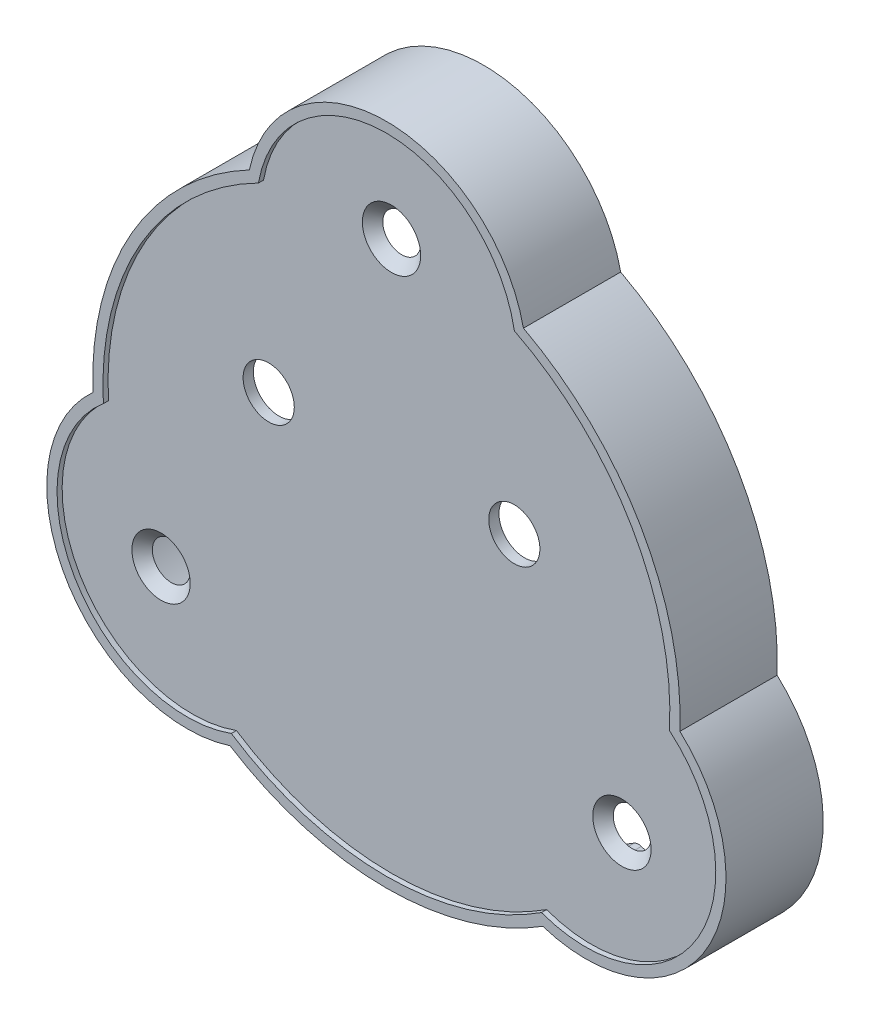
ISO-10303-21;
HEADER;
FILE_DESCRIPTION(('STEP AP214'),'2;1');
FILE_NAME('part.step','',(''),(''),'','','');
FILE_SCHEMA(('AUTOMOTIVE_DESIGN { 1 0 10303 214 1 1 1 1 }'));
ENDSEC;
DATA;
#1=APPLICATION_CONTEXT('core data for automotive mechanical design processes');
#2=APPLICATION_PROTOCOL_DEFINITION('international standard','automotive_design',2000,#1);
#3=PRODUCT_CONTEXT('',#1,'mechanical');
#4=PRODUCT('Part','Part','',(#3));
#5=PRODUCT_RELATED_PRODUCT_CATEGORY('part','',(#4));
#6=PRODUCT_DEFINITION_FORMATION('','',#4);
#7=PRODUCT_DEFINITION_CONTEXT('part definition',#1,'design');
#8=PRODUCT_DEFINITION('design','',#6,#7);
#9=PRODUCT_DEFINITION_SHAPE('','',#8);
#10=(LENGTH_UNIT() NAMED_UNIT(*) SI_UNIT(.MILLI.,.METRE.));
#11=(NAMED_UNIT(*) PLANE_ANGLE_UNIT() SI_UNIT($,.RADIAN.));
#12=(NAMED_UNIT(*) SI_UNIT($,.STERADIAN.) SOLID_ANGLE_UNIT());
#13=UNCERTAINTY_MEASURE_WITH_UNIT(LENGTH_MEASURE(1.E-05),#10,'distance_accuracy_value','');
#14=(GEOMETRIC_REPRESENTATION_CONTEXT(3) GLOBAL_UNCERTAINTY_ASSIGNED_CONTEXT((#13)) GLOBAL_UNIT_ASSIGNED_CONTEXT((#10,
#11,#12)) REPRESENTATION_CONTEXT('',''));
#15=CARTESIAN_POINT('',(0.,0.,0.));
#16=DIRECTION('',(0.,0.,1.));
#17=DIRECTION('',(1.,0.,0.));
#18=AXIS2_PLACEMENT_3D('',#15,#16,#17);
#19=CARTESIAN_POINT('',(22.9570260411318,-15.6393148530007,-3.06446978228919));
#20=DIRECTION('',(0.,0.,1.));
#21=DIRECTION('',(1.,0.,0.));
#22=AXIS2_PLACEMENT_3D('',#19,#20,#21);
#23=PLANE('',#22);
#24=CARTESIAN_POINT('',(44.6998118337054,-3.01431485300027,-3.06446978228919));
#25=DIRECTION('',(0.,0.,1.));
#26=DIRECTION('',(1.,0.,0.));
#27=AXIS2_PLACEMENT_3D('',#24,#25,#26);
#28=CIRCLE('',#27,2.49999999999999);
#29=CARTESIAN_POINT('',(47.1998118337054,-3.01431485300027,-3.06446978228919));
#30=VERTEX_POINT('',#29);
#31=EDGE_CURVE('E529',#30,#30,#28,.T.);
#32=ORIENTED_EDGE('',*,*,#31,.F.);
#33=EDGE_LOOP('',(#32));
#34=FACE_BOUND('',#33,.T.);
#35=CARTESIAN_POINT('',(20.6998118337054,-3.01431485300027,-3.06446978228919));
#36=DIRECTION('',(0.,0.,1.));
#37=DIRECTION('',(1.,0.,0.));
#38=AXIS2_PLACEMENT_3D('',#35,#36,#37);
#39=CIRCLE('',#38,2.5);
#40=CARTESIAN_POINT('',(23.1998118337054,-3.01431485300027,-3.06446978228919));
#41=VERTEX_POINT('',#40);
#42=EDGE_CURVE('E535',#41,#41,#39,.T.);
#43=ORIENTED_EDGE('',*,*,#42,.F.);
#44=EDGE_LOOP('',(#43));
#45=FACE_BOUND('',#44,.T.);
#46=CARTESIAN_POINT('',(32.6998118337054,15.9856851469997,-3.06446978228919));
#47=DIRECTION('',(0.,0.,1.));
#48=DIRECTION('',(1.,0.,0.));
#49=AXIS2_PLACEMENT_3D('',#46,#47,#48);
#50=CIRCLE('',#49,2.84999999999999);
#51=CARTESIAN_POINT('',(35.5498118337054,15.9856851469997,-3.06446978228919));
#52=VERTEX_POINT('',#51);
#53=EDGE_CURVE('E446',#52,#52,#50,.F.);
#54=ORIENTED_EDGE('',*,*,#53,.T.);
#55=EDGE_LOOP('',(#54));
#56=FACE_BOUND('',#55,.T.);
#57=CARTESIAN_POINT('',(55.216472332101,-23.0143148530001,-3.06446978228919));
#58=DIRECTION('',(0.,0.,1.));
#59=DIRECTION('',(1.,0.,0.));
#60=AXIS2_PLACEMENT_3D('',#57,#58,#59);
#61=CIRCLE('',#60,2.84999999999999);
#62=CARTESIAN_POINT('',(58.066472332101,-23.0143148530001,-3.06446978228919));
#63=VERTEX_POINT('',#62);
#64=EDGE_CURVE('E102',#63,#63,#61,.F.);
#65=ORIENTED_EDGE('',*,*,#64,.T.);
#66=EDGE_LOOP('',(#65));
#67=FACE_BOUND('',#66,.T.);
#68=CARTESIAN_POINT('',(10.1831513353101,-23.0143148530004,-3.06446978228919));
#69=DIRECTION('',(0.,0.,1.));
#70=DIRECTION('',(1.,0.,0.));
#71=AXIS2_PLACEMENT_3D('',#68,#69,#70);
#72=CIRCLE('',#71,2.84999999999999);
#73=CARTESIAN_POINT('',(13.0331513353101,-23.0143148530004,-3.06446978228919));
#74=VERTEX_POINT('',#73);
#75=EDGE_CURVE('E12',#74,#74,#72,.F.);
#76=ORIENTED_EDGE('',*,*,#75,.T.);
#77=EDGE_LOOP('',(#76));
#78=FACE_BOUND('',#77,.T.);
#79=CARTESIAN_POINT('',(32.6998118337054,12.4856851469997,-3.06446978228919));
#80=DIRECTION('',(0.,0.,1.));
#81=DIRECTION('',(1.,0.,0.));
#82=AXIS2_PLACEMENT_3D('',#79,#80,#81);
#83=CIRCLE('',#82,12.7);
#84=CARTESIAN_POINT('',(45.2048663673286,14.7023518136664,-3.06446978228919));
#85=VERTEX_POINT('',#84);
#86=CARTESIAN_POINT('',(20.1947573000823,14.7023518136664,-3.06446978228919));
#87=VERTEX_POINT('',#86);
#88=EDGE_CURVE('E117',#85,#87,#83,.T.);
#89=ORIENTED_EDGE('',*,*,#88,.T.);
#90=CARTESIAN_POINT('',(32.6998118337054,-10.0143148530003,-3.06446978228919));
#91=DIRECTION('',(0.,0.,1.));
#92=DIRECTION('',(1.,0.,0.));
#93=AXIS2_PLACEMENT_3D('',#90,#91,#92);
#94=CIRCLE('',#93,27.7);
#95=CARTESIAN_POINT('',(5.04202333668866,-11.5429532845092,-3.06446978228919));
#96=VERTEX_POINT('',#95);
#97=EDGE_CURVE('E700',#87,#96,#94,.T.);
#98=ORIENTED_EDGE('',*,*,#97,.T.);
#99=CARTESIAN_POINT('',(13.2142402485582,-21.2643148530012,-3.06446978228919));
#100=DIRECTION('',(0.,0.,1.));
#101=DIRECTION('',(1.,0.,0.));
#102=AXIS2_PLACEMENT_3D('',#99,#100,#101);
#103=CIRCLE('',#102,12.7);
#104=CARTESIAN_POINT('',(17.5470778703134,-33.2023430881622,-3.06446978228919));
#105=VERTEX_POINT('',#104);
#106=EDGE_CURVE('E719',#96,#105,#103,.T.);
#107=ORIENTED_EDGE('',*,*,#106,.T.);
#108=CARTESIAN_POINT('',(32.6998118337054,-10.0143148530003,-3.06446978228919));
#109=DIRECTION('',(0.,0.,1.));
#110=DIRECTION('',(1.,0.,0.));
#111=AXIS2_PLACEMENT_3D('',#108,#109,#110);
#112=CIRCLE('',#111,27.7);
#113=CARTESIAN_POINT('',(47.8525457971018,-33.2023430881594,-3.06446978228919));
#114=VERTEX_POINT('',#113);
#115=EDGE_CURVE('E721',#105,#114,#112,.T.);
#116=ORIENTED_EDGE('',*,*,#115,.T.);
#117=CARTESIAN_POINT('',(52.1853834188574,-21.2643148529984,-3.06446978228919));
#118=DIRECTION('',(0.,0.,1.));
#119=DIRECTION('',(1.,0.,0.));
#120=AXIS2_PLACEMENT_3D('',#117,#118,#119);
#121=CIRCLE('',#120,12.7);
#122=CARTESIAN_POINT('',(60.3576003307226,-11.5429532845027,-3.06446978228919));
#123=VERTEX_POINT('',#122);
#124=EDGE_CURVE('E723',#114,#123,#121,.T.);
#125=ORIENTED_EDGE('',*,*,#124,.T.);
#126=CARTESIAN_POINT('',(32.6998118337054,-10.0143148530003,-3.06446978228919));
#127=DIRECTION('',(0.,0.,1.));
#128=DIRECTION('',(1.,0.,0.));
#129=AXIS2_PLACEMENT_3D('',#126,#127,#128);
#130=CIRCLE('',#129,27.7);
#131=EDGE_CURVE('E706',#123,#85,#130,.T.);
#132=ORIENTED_EDGE('',*,*,#131,.T.);
#133=EDGE_LOOP('',(#89,#98,#107,#116,#125,#132));
#134=FACE_BOUND('',#133,.T.);
#135=ADVANCED_FACE('F93',(#34,#45,#56,#67,#78,#134),#23,.T.);
#136=CARTESIAN_POINT('',(13.2142402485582,-21.2643148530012,-12.0644697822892));
#137=DIRECTION('',(0.,0.,1.));
#138=DIRECTION('',(1.,0.,0.));
#139=AXIS2_PLACEMENT_3D('',#136,#137,#138);
#140=CYLINDRICAL_SURFACE('',#139,13.7);
#141=DIRECTION('',(0.,0.,1.));
#142=VECTOR('',#141,1.);
#143=CARTESIAN_POINT('',(17.4137738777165,-34.3047871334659,-12.0644697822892));
#144=LINE('',#143,#142);
#145=CARTESIAN_POINT('',(17.4137738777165,-34.3047871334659,-12.0644697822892));
#146=VERTEX_POINT('',#145);
#147=CARTESIAN_POINT('',(17.4137738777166,-34.3047871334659,-2.56446978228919));
#148=VERTEX_POINT('',#147);
#149=EDGE_CURVE('E443',#146,#148,#144,.T.);
#150=ORIENTED_EDGE('',*,*,#149,.T.);
#151=CARTESIAN_POINT('',(13.2142402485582,-21.2643148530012,-2.56446978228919));
#152=DIRECTION('',(0.,0.,1.));
#153=DIRECTION('',(1.,0.,0.));
#154=AXIS2_PLACEMENT_3D('',#151,#152,#153);
#155=CIRCLE('',#154,13.7);
#156=CARTESIAN_POINT('',(4.02062679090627,-11.1071759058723,-2.56446978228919));
#157=VERTEX_POINT('',#156);
#158=EDGE_CURVE('E505',#157,#148,#155,.T.);
#159=ORIENTED_EDGE('',*,*,#158,.F.);
#160=DIRECTION('',(0.,0.,1.));
#161=VECTOR('',#160,1.);
#162=CARTESIAN_POINT('',(4.02062679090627,-11.1071759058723,-12.0644697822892));
#163=LINE('',#162,#161);
#164=CARTESIAN_POINT('',(4.02062679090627,-11.1071759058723,-12.0644697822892));
#165=VERTEX_POINT('',#164);
#166=EDGE_CURVE('E444',#165,#157,#163,.T.);
#167=ORIENTED_EDGE('',*,*,#166,.F.);
#168=CARTESIAN_POINT('',(13.2142402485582,-21.2643148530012,-12.0644697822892));
#169=DIRECTION('',(0.,0.,1.));
#170=DIRECTION('',(1.,0.,0.));
#171=AXIS2_PLACEMENT_3D('',#168,#169,#170);
#172=CIRCLE('',#171,13.7);
#173=EDGE_CURVE('E395',#165,#146,#172,.T.);
#174=ORIENTED_EDGE('',*,*,#173,.T.);
#175=EDGE_LOOP('',(#150,#159,#167,#174));
#176=FACE_BOUND('',#175,.T.);
#177=ADVANCED_FACE('F504',(#176),#140,.T.);
#178=CARTESIAN_POINT('',(32.6998118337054,-10.0143148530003,-12.0644697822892));
#179=DIRECTION('',(0.,0.,1.));
#180=DIRECTION('',(1.,0.,0.));
#181=AXIS2_PLACEMENT_3D('',#178,#179,#180);
#182=CYLINDRICAL_SURFACE('',#181,28.7);
#183=ORIENTED_EDGE('',*,*,#166,.T.);
#184=CARTESIAN_POINT('',(32.6998118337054,-10.0143148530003,-2.56446978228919));
#185=DIRECTION('',(0.,0.,1.));
#186=DIRECTION('',(1.,0.,0.));
#187=AXIS2_PLACEMENT_3D('',#184,#185,#186);
#188=CIRCLE('',#187,28.7);
#189=CARTESIAN_POINT('',(19.3066647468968,15.369018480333,-2.56446978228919));
#190=VERTEX_POINT('',#189);
#191=EDGE_CURVE('E514',#190,#157,#188,.T.);
#192=ORIENTED_EDGE('',*,*,#191,.F.);
#193=DIRECTION('',(0.,0.,1.));
#194=VECTOR('',#193,1.);
#195=CARTESIAN_POINT('',(19.3066647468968,15.369018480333,-12.0644697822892));
#196=LINE('',#195,#194);
#197=CARTESIAN_POINT('',(19.3066647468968,15.369018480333,-12.0644697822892));
#198=VERTEX_POINT('',#197);
#199=EDGE_CURVE('E447',#198,#190,#196,.T.);
#200=ORIENTED_EDGE('',*,*,#199,.F.);
#201=CARTESIAN_POINT('',(32.6998118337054,-10.0143148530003,-12.0644697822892));
#202=DIRECTION('',(0.,0.,1.));
#203=DIRECTION('',(1.,0.,0.));
#204=AXIS2_PLACEMENT_3D('',#201,#202,#203);
#205=CIRCLE('',#204,28.7);
#206=EDGE_CURVE('E440',#198,#165,#205,.T.);
#207=ORIENTED_EDGE('',*,*,#206,.T.);
#208=EDGE_LOOP('',(#183,#192,#200,#207));
#209=FACE_BOUND('',#208,.T.);
#210=ADVANCED_FACE('F559',(#209),#182,.T.);
#211=CARTESIAN_POINT('',(32.6998118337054,12.4856851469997,-12.0644697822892));
#212=DIRECTION('',(0.,0.,1.));
#213=DIRECTION('',(1.,0.,0.));
#214=AXIS2_PLACEMENT_3D('',#211,#212,#213);
#215=CYLINDRICAL_SURFACE('',#214,13.7);
#216=ORIENTED_EDGE('',*,*,#199,.T.);
#217=CARTESIAN_POINT('',(32.6998118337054,12.4856851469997,-2.56446978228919));
#218=DIRECTION('',(0.,0.,1.));
#219=DIRECTION('',(1.,0.,0.));
#220=AXIS2_PLACEMENT_3D('',#217,#218,#219);
#221=CIRCLE('',#220,13.7);
#222=CARTESIAN_POINT('',(46.092958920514,15.3690184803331,-2.56446978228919));
#223=VERTEX_POINT('',#222);
#224=EDGE_CURVE('E526',#223,#190,#221,.T.);
#225=ORIENTED_EDGE('',*,*,#224,.F.);
#226=DIRECTION('',(0.,0.,1.));
#227=VECTOR('',#226,1.);
#228=CARTESIAN_POINT('',(46.092958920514,15.3690184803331,-12.0644697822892));
#229=LINE('',#228,#227);
#230=CARTESIAN_POINT('',(46.092958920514,15.3690184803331,-12.0644697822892));
#231=VERTEX_POINT('',#230);
#232=EDGE_CURVE('E449',#231,#223,#229,.T.);
#233=ORIENTED_EDGE('',*,*,#232,.F.);
#234=CARTESIAN_POINT('',(32.6998118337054,12.4856851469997,-12.0644697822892));
#235=DIRECTION('',(0.,0.,1.));
#236=DIRECTION('',(1.,0.,0.));
#237=AXIS2_PLACEMENT_3D('',#234,#235,#236);
#238=CIRCLE('',#237,13.7);
#239=EDGE_CURVE('E437',#231,#198,#238,.T.);
#240=ORIENTED_EDGE('',*,*,#239,.T.);
#241=EDGE_LOOP('',(#216,#225,#233,#240));
#242=FACE_BOUND('',#241,.T.);
#243=ADVANCED_FACE('F616',(#242),#215,.T.);
#244=CARTESIAN_POINT('',(32.6998118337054,-10.0143148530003,-12.0644697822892));
#245=DIRECTION('',(0.,0.,1.));
#246=DIRECTION('',(1.,0.,0.));
#247=AXIS2_PLACEMENT_3D('',#244,#245,#246);
#248=CYLINDRICAL_SURFACE('',#247,28.7);
#249=ORIENTED_EDGE('',*,*,#232,.T.);
#250=CARTESIAN_POINT('',(32.6998118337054,-10.0143148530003,-2.56446978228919));
#251=DIRECTION('',(0.,0.,1.));
#252=DIRECTION('',(1.,0.,0.));
#253=AXIS2_PLACEMENT_3D('',#250,#251,#252);
#254=CIRCLE('',#253,28.7);
#255=CARTESIAN_POINT('',(61.3789968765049,-11.1071759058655,-2.56446978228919));
#256=VERTEX_POINT('',#255);
#257=EDGE_CURVE('E523',#256,#223,#254,.T.);
#258=ORIENTED_EDGE('',*,*,#257,.F.);
#259=DIRECTION('',(0.,0.,1.));
#260=VECTOR('',#259,1.);
#261=CARTESIAN_POINT('',(61.3789968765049,-11.1071759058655,-12.0644697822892));
#262=LINE('',#261,#260);
#263=CARTESIAN_POINT('',(61.3789968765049,-11.1071759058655,-12.0644697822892));
#264=VERTEX_POINT('',#263);
#265=EDGE_CURVE('E451',#264,#256,#262,.T.);
#266=ORIENTED_EDGE('',*,*,#265,.F.);
#267=CARTESIAN_POINT('',(32.6998118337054,-10.0143148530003,-12.0644697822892));
#268=DIRECTION('',(0.,0.,1.));
#269=DIRECTION('',(1.,0.,0.));
#270=AXIS2_PLACEMENT_3D('',#267,#268,#269);
#271=CIRCLE('',#270,28.7);
#272=EDGE_CURVE('E434',#264,#231,#271,.T.);
#273=ORIENTED_EDGE('',*,*,#272,.T.);
#274=EDGE_LOOP('',(#249,#258,#266,#273));
#275=FACE_BOUND('',#274,.T.);
#276=ADVANCED_FACE('F620',(#275),#248,.T.);
#277=CARTESIAN_POINT('',(52.1853834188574,-21.2643148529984,-12.0644697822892));
#278=DIRECTION('',(0.,0.,1.));
#279=DIRECTION('',(1.,0.,0.));
#280=AXIS2_PLACEMENT_3D('',#277,#278,#279);
#281=CYLINDRICAL_SURFACE('',#280,13.7);
#282=ORIENTED_EDGE('',*,*,#265,.T.);
#283=CARTESIAN_POINT('',(52.1853834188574,-21.2643148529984,-2.56446978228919));
#284=DIRECTION('',(0.,0.,1.));
#285=DIRECTION('',(1.,0.,0.));
#286=AXIS2_PLACEMENT_3D('',#283,#284,#285);
#287=CIRCLE('',#286,13.7);
#288=CARTESIAN_POINT('',(47.9858497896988,-34.3047871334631,-2.56446978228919));
#289=VERTEX_POINT('',#288);
#290=EDGE_CURVE('E516',#289,#256,#287,.T.);
#291=ORIENTED_EDGE('',*,*,#290,.F.);
#292=DIRECTION('',(0.,0.,1.));
#293=VECTOR('',#292,1.);
#294=CARTESIAN_POINT('',(47.9858497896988,-34.3047871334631,-12.0644697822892));
#295=LINE('',#294,#293);
#296=CARTESIAN_POINT('',(47.9858497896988,-34.3047871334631,-12.0644697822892));
#297=VERTEX_POINT('',#296);
#298=EDGE_CURVE('E453',#297,#289,#295,.T.);
#299=ORIENTED_EDGE('',*,*,#298,.F.);
#300=CARTESIAN_POINT('',(52.1853834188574,-21.2643148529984,-12.0644697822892));
#301=DIRECTION('',(0.,0.,1.));
#302=DIRECTION('',(1.,0.,0.));
#303=AXIS2_PLACEMENT_3D('',#300,#301,#302);
#304=CIRCLE('',#303,13.7);
#305=EDGE_CURVE('E431',#297,#264,#304,.T.);
#306=ORIENTED_EDGE('',*,*,#305,.T.);
#307=EDGE_LOOP('',(#282,#291,#299,#306));
#308=FACE_BOUND('',#307,.T.);
#309=ADVANCED_FACE('F624',(#308),#281,.T.);
#310=CARTESIAN_POINT('',(32.6998118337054,-10.0143148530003,-12.0644697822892));
#311=DIRECTION('',(0.,0.,1.));
#312=DIRECTION('',(1.,0.,0.));
#313=AXIS2_PLACEMENT_3D('',#310,#311,#312);
#314=CYLINDRICAL_SURFACE('',#313,28.7);
#315=DIRECTION('',(0.,0.,1.));
#316=VECTOR('',#315,1.);
#317=CARTESIAN_POINT('',(35.6998118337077,-38.5570897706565,-12.0644697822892));
#318=LINE('',#317,#316);
#319=CARTESIAN_POINT('',(35.6998118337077,-38.5570897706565,-12.0644697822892));
#320=VERTEX_POINT('',#319);
#321=CARTESIAN_POINT('',(35.6998118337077,-38.5570897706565,-8.4644697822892));
#322=VERTEX_POINT('',#321);
#323=EDGE_CURVE('E699',#320,#322,#318,.T.);
#324=ORIENTED_EDGE('',*,*,#323,.F.);
#325=CARTESIAN_POINT('',(32.6998118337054,-10.0143148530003,-12.0644697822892));
#326=DIRECTION('',(0.,0.,1.));
#327=DIRECTION('',(1.,0.,0.));
#328=AXIS2_PLACEMENT_3D('',#325,#326,#327);
#329=CIRCLE('',#328,28.7);
#330=EDGE_CURVE('E312',#320,#297,#329,.T.);
#331=ORIENTED_EDGE('',*,*,#330,.T.);
#332=ORIENTED_EDGE('',*,*,#298,.T.);
#333=CARTESIAN_POINT('',(32.6998118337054,-10.0143148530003,-2.56446978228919));
#334=DIRECTION('',(0.,0.,1.));
#335=DIRECTION('',(1.,0.,0.));
#336=AXIS2_PLACEMENT_3D('',#333,#334,#335);
#337=CIRCLE('',#336,28.7);
#338=EDGE_CURVE('E500',#148,#289,#337,.T.);
#339=ORIENTED_EDGE('',*,*,#338,.F.);
#340=ORIENTED_EDGE('',*,*,#149,.F.);
#341=CARTESIAN_POINT('',(29.6998118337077,-38.557089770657,-12.0644697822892));
#342=VERTEX_POINT('',#341);
#343=EDGE_CURVE('E428',#146,#342,#329,.T.);
#344=ORIENTED_EDGE('',*,*,#343,.T.);
#345=DIRECTION('',(0.,0.,1.));
#346=VECTOR('',#345,1.);
#347=CARTESIAN_POINT('',(29.6998118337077,-38.557089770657,-12.0644697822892));
#348=LINE('',#347,#346);
#349=CARTESIAN_POINT('',(29.6998118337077,-38.557089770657,-8.4644697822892));
#350=VERTEX_POINT('',#349);
#351=EDGE_CURVE('E497',#350,#342,#348,.F.);
#352=ORIENTED_EDGE('',*,*,#351,.F.);
#353=CARTESIAN_POINT('',(32.5998118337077,-38.7141406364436,-5.5644697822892));
#354=CARTESIAN_POINT('',(32.518446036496,-38.7138604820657,-5.56446172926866));
#355=CARTESIAN_POINT('',(32.4370855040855,-38.7132276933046,-5.56789407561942));
#356=CARTESIAN_POINT('',(32.2749532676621,-38.711283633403,-5.58157657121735));
#357=CARTESIAN_POINT('',(32.1941815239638,-38.7099724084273,-5.59182625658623));
#358=CARTESIAN_POINT('',(32.0338716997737,-38.7066998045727,-5.61906723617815));
#359=CARTESIAN_POINT('',(31.9543324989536,-38.7047390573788,-5.63605198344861));
#360=CARTESIAN_POINT('',(31.7969965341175,-38.7002196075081,-5.67662168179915));
#361=CARTESIAN_POINT('',(31.7191997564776,-38.6976609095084,-5.70020658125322));
#362=CARTESIAN_POINT('',(31.4891858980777,-38.6891787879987,-5.78065929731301));
#363=CARTESIAN_POINT('',(31.340264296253,-38.6824475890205,-5.84723897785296));
#364=CARTESIAN_POINT('',(31.0558093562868,-38.6675453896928,-6.00428910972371));
#365=CARTESIAN_POINT('',(30.9202747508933,-38.6593745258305,-6.0947572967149));
#366=CARTESIAN_POINT('',(30.6658218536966,-38.6424339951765,-6.29739680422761));
#367=CARTESIAN_POINT('',(30.5469592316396,-38.6336624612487,-6.40963798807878));
#368=CARTESIAN_POINT('',(30.3297145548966,-38.6164922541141,-6.65250647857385));
#369=CARTESIAN_POINT('',(30.2313364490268,-38.6080936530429,-6.78313732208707));
#370=CARTESIAN_POINT('',(30.0576679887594,-38.5925709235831,-7.05940969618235));
#371=CARTESIAN_POINT('',(29.9824302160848,-38.5854497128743,-7.20508442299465));
#372=CARTESIAN_POINT('',(29.857547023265,-38.5732975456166,-7.50705785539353));
#373=CARTESIAN_POINT('',(29.8078857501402,-38.5682652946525,-7.66334991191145));
#374=CARTESIAN_POINT('',(29.7478356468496,-38.5621065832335,-7.92790056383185));
#375=CARTESIAN_POINT('',(29.7298401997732,-38.5602343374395,-8.03447731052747));
#376=CARTESIAN_POINT('',(29.7058285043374,-38.5577222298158,-8.2488438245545));
#377=CARTESIAN_POINT('',(29.6997965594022,-38.5570807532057,-8.356631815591));
#378=CARTESIAN_POINT('',(29.6998118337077,-38.557089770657,-8.4644697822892));
#379=B_SPLINE_CURVE_WITH_KNOTS('',3,(#353,#354,#355,#356,#357,#358,#359,#360,#361,#362,#363,
#364,#365,#366,#367,#368,#369,#370,#371,#372,#373,#374,#375,#376,#377,#378),.UNSPECIFIED.,.F.,
.F.,(4,2,2,2,2,2,2,2,2,2,2,2,4),(0.,0.244018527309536,0.488020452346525,0.731785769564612,
0.975549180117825,1.46283253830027,1.9500697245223,2.43889697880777,2.92781837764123,
3.41784268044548,3.907562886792,4.23123453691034,4.55448123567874),.UNSPECIFIED.);
#380=CARTESIAN_POINT('',(32.5998118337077,-38.7141406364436,-5.5644697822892));
#381=VERTEX_POINT('',#380);
#382=EDGE_CURVE('E643',#381,#350,#379,.T.);
#383=ORIENTED_EDGE('',*,*,#382,.F.);
#384=CARTESIAN_POINT('',(32.6998118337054,-10.0143148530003,-5.5644697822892));
#385=DIRECTION('',(0.,0.,1.));
#386=DIRECTION('',(1.,0.,0.));
#387=AXIS2_PLACEMENT_3D('',#384,#385,#386);
#388=CIRCLE('',#387,28.7);
#389=CARTESIAN_POINT('',(32.7998118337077,-38.7141406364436,-5.5644697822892));
#390=VERTEX_POINT('',#389);
#391=EDGE_CURVE('E650',#390,#381,#388,.F.);
#392=ORIENTED_EDGE('',*,*,#391,.F.);
#393=CARTESIAN_POINT('',(35.6998118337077,-38.5570897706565,-8.4644697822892));
#394=CARTESIAN_POINT('',(35.6998199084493,-38.5570863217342,-8.38314198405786));
#395=CARTESIAN_POINT('',(35.6963907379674,-38.5574492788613,-8.3018181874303));
#396=CARTESIAN_POINT('',(35.6827204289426,-38.5588825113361,-8.13975678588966));
#397=CARTESIAN_POINT('',(35.6724797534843,-38.5599527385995,-8.05901914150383));
#398=CARTESIAN_POINT('',(35.645262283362,-38.5627736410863,-7.8987755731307));
#399=CARTESIAN_POINT('',(35.6282920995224,-38.5645236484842,-7.81926851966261));
#400=CARTESIAN_POINT('',(35.5877567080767,-38.5686522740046,-7.66199406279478));
#401=CARTESIAN_POINT('',(35.564191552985,-38.5710308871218,-7.584226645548));
#402=CARTESIAN_POINT('',(35.4838055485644,-38.5790190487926,-7.35429659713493));
#403=CARTESIAN_POINT('',(35.4172803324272,-38.5854824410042,-7.20542524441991));
#404=CARTESIAN_POINT('',(35.2603583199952,-38.5999715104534,-6.92105757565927));
#405=CARTESIAN_POINT('',(35.1699637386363,-38.6079970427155,-6.78556002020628));
#406=CARTESIAN_POINT('',(34.9674782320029,-38.6247678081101,-6.53114959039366));
#407=CARTESIAN_POINT('',(34.855314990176,-38.6335153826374,-6.41229433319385));
#408=CARTESIAN_POINT('',(34.6126140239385,-38.6507593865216,-6.19504671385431));
#409=CARTESIAN_POINT('',(34.4820727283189,-38.6592557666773,-6.09665833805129));
#410=CARTESIAN_POINT('',(34.2059282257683,-38.6751029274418,-5.92290998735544));
#411=CARTESIAN_POINT('',(34.0602856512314,-38.6824505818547,-5.84761233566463));
#412=CARTESIAN_POINT('',(33.7583672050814,-38.695183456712,-5.72260447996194));
#413=CARTESIAN_POINT('',(33.6020979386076,-38.7005698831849,-5.67287854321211));
#414=CARTESIAN_POINT('',(33.3373778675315,-38.7074265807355,-5.61267379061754));
#415=CARTESIAN_POINT('',(33.2306084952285,-38.7096051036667,-5.59461119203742));
#416=CARTESIAN_POINT('',(33.0158462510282,-38.7127775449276,-5.57050936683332));
#417=CARTESIAN_POINT('',(32.9078551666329,-38.7137730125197,-5.56445440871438));
#418=CARTESIAN_POINT('',(32.7998118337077,-38.7141406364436,-5.5644697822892));
#419=B_SPLINE_CURVE_WITH_KNOTS('',3,(#393,#394,#395,#396,#397,#398,#399,#400,#401,#402,#403,
#404,#405,#406,#407,#408,#409,#410,#411,#412,#413,#414,#415,#416,#417,#418),.UNSPECIFIED.,.F.,
.F.,(4,2,2,2,2,2,2,2,2,2,2,2,4),(0.,0.243903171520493,0.487789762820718,0.731437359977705,
0.97508301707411,1.46213109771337,1.94913399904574,2.43778333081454,2.92652774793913,
3.41657993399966,3.90633025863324,4.23061915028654,4.5544829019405),.UNSPECIFIED.);
#420=EDGE_CURVE('E634',#322,#390,#419,.T.);
#421=ORIENTED_EDGE('',*,*,#420,.F.);
#422=EDGE_LOOP('',(#324,#331,#332,#339,#340,#344,#352,#383,#392,#421));
#423=FACE_BOUND('',#422,.T.);
#424=ADVANCED_FACE('F495',(#423),#314,.T.);
#425=CARTESIAN_POINT('',(22.9570260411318,-15.6393148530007,-12.0644697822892));
#426=DIRECTION('',(0.,0.,1.));
#427=DIRECTION('',(1.,0.,0.));
#428=AXIS2_PLACEMENT_3D('',#425,#426,#427);
#429=PLANE('',#428);
#430=ORIENTED_EDGE('',*,*,#330,.F.);
#431=DIRECTION('',(0.,-1.,0.));
#432=VECTOR('',#431,1.);
#433=CARTESIAN_POINT('',(35.6998118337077,26.1866851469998,-12.0644697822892));
#434=LINE('',#433,#432);
#435=CARTESIAN_POINT('',(35.6998118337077,-36.5452402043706,-12.0644697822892));
#436=VERTEX_POINT('',#435);
#437=EDGE_CURVE('E294',#436,#320,#434,.T.);
#438=ORIENTED_EDGE('',*,*,#437,.F.);
#439=CARTESIAN_POINT('',(32.6998118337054,-10.0143148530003,-12.0644697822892));
#440=DIRECTION('',(0.,0.,1.));
#441=DIRECTION('',(1.,0.,0.));
#442=AXIS2_PLACEMENT_3D('',#439,#440,#441);
#443=CIRCLE('',#442,26.7);
#444=CARTESIAN_POINT('',(47.3869556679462,-32.3117991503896,-12.0644697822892));
#445=VERTEX_POINT('',#444);
#446=EDGE_CURVE('E309',#436,#445,#443,.T.);
#447=ORIENTED_EDGE('',*,*,#446,.T.);
#448=CARTESIAN_POINT('',(47.82701990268,-32.9798885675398,-12.0644697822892));
#449=DIRECTION('',(0.,0.,-1.));
#450=DIRECTION('',(1.,0.,0.));
#451=AXIS2_PLACEMENT_3D('',#448,#449,#450);
#452=CIRCLE('',#451,0.800000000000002);
#453=CARTESIAN_POINT('',(48.1059551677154,-32.2300918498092,-12.0644697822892));
#454=VERTEX_POINT('',#453);
#455=EDGE_CURVE('E324',#445,#454,#452,.T.);
#456=ORIENTED_EDGE('',*,*,#455,.T.);
#457=CARTESIAN_POINT('',(52.1853834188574,-21.2643148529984,-12.0644697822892));
#458=DIRECTION('',(0.,0.,1.));
#459=DIRECTION('',(1.,0.,0.));
#460=AXIS2_PLACEMENT_3D('',#457,#458,#459);
#461=CIRCLE('',#460,11.7);
#462=CARTESIAN_POINT('',(59.6423107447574,-12.2485378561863,-12.0644697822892));
#463=VERTEX_POINT('',#462);
#464=EDGE_CURVE('E331',#454,#463,#461,.T.);
#465=ORIENTED_EDGE('',*,*,#464,.T.);
#466=CARTESIAN_POINT('',(60.1521861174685,-11.6320744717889,-12.0644697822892));
#467=DIRECTION('',(0.,0.,-1.));
#468=DIRECTION('',(1.,0.,0.));
#469=AXIS2_PLACEMENT_3D('',#466,#467,#468);
#470=CIRCLE('',#469,0.799999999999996);
#471=CARTESIAN_POINT('',(59.35357159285,-11.5850123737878,-12.0644697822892));
#472=VERTEX_POINT('',#471);
#473=EDGE_CURVE('E334',#463,#472,#470,.T.);
#474=ORIENTED_EDGE('',*,*,#473,.T.);
#475=CARTESIAN_POINT('',(32.6998118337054,-10.0143148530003,-12.0644697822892));
#476=DIRECTION('',(0.,0.,1.));
#477=DIRECTION('',(1.,0.,0.));
#478=AXIS2_PLACEMENT_3D('',#475,#476,#477);
#479=CIRCLE('',#478,26.7);
#480=CARTESIAN_POINT('',(44.6664277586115,13.8538669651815,-12.0644697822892));
#481=VERTEX_POINT('',#480);
#482=EDGE_CURVE('E337',#472,#481,#479,.T.);
#483=ORIENTED_EDGE('',*,*,#482,.T.);
#484=CARTESIAN_POINT('',(45.0249780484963,14.5690184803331,-12.0644697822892));
#485=DIRECTION('',(0.,0.,-1.));
#486=DIRECTION('',(1.,0.,0.));
#487=AXIS2_PLACEMENT_3D('',#484,#485,#486);
#488=CIRCLE('',#487,0.800000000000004);
#489=CARTESIAN_POINT('',(44.2361674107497,14.4356851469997,-12.0644697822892));
#490=VERTEX_POINT('',#489);
#491=EDGE_CURVE('E340',#481,#490,#488,.T.);
#492=ORIENTED_EDGE('',*,*,#491,.T.);
#493=CARTESIAN_POINT('',(32.6998118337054,12.4856851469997,-12.0644697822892));
#494=DIRECTION('',(0.,0.,1.));
#495=DIRECTION('',(1.,0.,0.));
#496=AXIS2_PLACEMENT_3D('',#493,#494,#495);
#497=CIRCLE('',#496,11.7);
#498=CARTESIAN_POINT('',(21.1634562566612,14.4356851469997,-12.0644697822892));
#499=VERTEX_POINT('',#498);
#500=EDGE_CURVE('E343',#490,#499,#497,.T.);
#501=ORIENTED_EDGE('',*,*,#500,.T.);
#502=CARTESIAN_POINT('',(20.3746456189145,14.569018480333,-12.0644697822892));
#503=DIRECTION('',(0.,0.,-1.));
#504=DIRECTION('',(1.,0.,0.));
#505=AXIS2_PLACEMENT_3D('',#502,#503,#504);
#506=CIRCLE('',#505,0.8);
#507=CARTESIAN_POINT('',(20.7331959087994,13.8538669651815,-12.0644697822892));
#508=VERTEX_POINT('',#507);
#509=EDGE_CURVE('E346',#499,#508,#506,.T.);
#510=ORIENTED_EDGE('',*,*,#509,.T.);
#511=CARTESIAN_POINT('',(32.6998118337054,-10.0143148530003,-12.0644697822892));
#512=DIRECTION('',(0.,0.,1.));
#513=DIRECTION('',(1.,0.,0.));
#514=AXIS2_PLACEMENT_3D('',#511,#512,#513);
#515=CIRCLE('',#514,26.7);
#516=CARTESIAN_POINT('',(6.04605207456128,-11.585012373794,-12.0644697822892));
#517=VERTEX_POINT('',#516);
#518=EDGE_CURVE('E349',#508,#517,#515,.T.);
#519=ORIENTED_EDGE('',*,*,#518,.T.);
#520=CARTESIAN_POINT('',(5.24743754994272,-11.6320744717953,-12.0644697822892));
#521=DIRECTION('',(0.,0.,-1.));
#522=DIRECTION('',(1.,0.,0.));
#523=AXIS2_PLACEMENT_3D('',#520,#521,#522);
#524=CIRCLE('',#523,0.800000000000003);
#525=CARTESIAN_POINT('',(5.75731292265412,-12.2485378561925,-12.0644697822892));
#526=VERTEX_POINT('',#525);
#527=EDGE_CURVE('E352',#517,#526,#524,.T.);
#528=ORIENTED_EDGE('',*,*,#527,.T.);
#529=CARTESIAN_POINT('',(13.2142402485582,-21.2643148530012,-12.0644697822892));
#530=DIRECTION('',(0.,0.,1.));
#531=DIRECTION('',(1.,0.,0.));
#532=AXIS2_PLACEMENT_3D('',#529,#530,#531);
#533=CIRCLE('',#532,11.7);
#534=CARTESIAN_POINT('',(17.2936684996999,-32.2300918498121,-12.0644697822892));
#535=VERTEX_POINT('',#534);
#536=EDGE_CURVE('E326',#526,#535,#533,.T.);
#537=ORIENTED_EDGE('',*,*,#536,.T.);
#538=CARTESIAN_POINT('',(17.5726037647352,-32.9798885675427,-12.0644697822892));
#539=DIRECTION('',(0.,0.,-1.));
#540=DIRECTION('',(1.,0.,0.));
#541=AXIS2_PLACEMENT_3D('',#538,#539,#540);
#542=CIRCLE('',#541,0.799999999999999);
#543=CARTESIAN_POINT('',(18.0126679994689,-32.3117991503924,-12.0644697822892));
#544=VERTEX_POINT('',#543);
#545=EDGE_CURVE('E321',#535,#544,#542,.T.);
#546=ORIENTED_EDGE('',*,*,#545,.T.);
#547=CARTESIAN_POINT('',(29.6998118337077,-36.5452402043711,-12.0644697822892));
#548=VERTEX_POINT('',#547);
#549=EDGE_CURVE('E320',#544,#548,#443,.T.);
#550=ORIENTED_EDGE('',*,*,#549,.T.);
#551=DIRECTION('',(0.,-1.,0.));
#552=VECTOR('',#551,1.);
#553=CARTESIAN_POINT('',(29.6998118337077,26.1866851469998,-12.0644697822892));
#554=LINE('',#553,#552);
#555=EDGE_CURVE('E313',#548,#342,#554,.T.);
#556=ORIENTED_EDGE('',*,*,#555,.T.);
#557=ORIENTED_EDGE('',*,*,#343,.F.);
#558=ORIENTED_EDGE('',*,*,#173,.F.);
#559=ORIENTED_EDGE('',*,*,#206,.F.);
#560=ORIENTED_EDGE('',*,*,#239,.F.);
#561=ORIENTED_EDGE('',*,*,#272,.F.);
#562=ORIENTED_EDGE('',*,*,#305,.F.);
#563=EDGE_LOOP('',(#430,#438,#447,#456,#465,#474,#483,#492,#501,#510,#519,#528,#537,#546,#550,
#556,#557,#558,#559,#560,#561,#562));
#564=FACE_BOUND('',#563,.T.);
#565=ADVANCED_FACE('F307',(#564),#429,.F.);
#566=CARTESIAN_POINT('',(13.2142402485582,-21.2643148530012,-12.0644697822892));
#567=DIRECTION('',(0.,0.,1.));
#568=DIRECTION('',(1.,0.,0.));
#569=AXIS2_PLACEMENT_3D('',#566,#567,#568);
#570=CYLINDRICAL_SURFACE('',#569,11.7);
#571=CARTESIAN_POINT('',(13.2142402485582,-21.2643148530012,-4.06446978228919));
#572=DIRECTION('',(0.,0.,1.));
#573=DIRECTION('',(1.,0.,0.));
#574=AXIS2_PLACEMENT_3D('',#571,#572,#573);
#575=CIRCLE('',#574,11.7);
#576=CARTESIAN_POINT('',(5.75731292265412,-12.2485378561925,-4.06446978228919));
#577=VERTEX_POINT('',#576);
#578=CARTESIAN_POINT('',(17.2936684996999,-32.2300918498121,-4.06446978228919));
#579=VERTEX_POINT('',#578);
#580=EDGE_CURVE('E356',#577,#579,#575,.T.);
#581=ORIENTED_EDGE('',*,*,#580,.T.);
#582=DIRECTION('',(0.,0.,1.));
#583=VECTOR('',#582,1.);
#584=CARTESIAN_POINT('',(17.2936684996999,-32.2300918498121,-12.0644697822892));
#585=LINE('',#584,#583);
#586=EDGE_CURVE('E355',#535,#579,#585,.T.);
#587=ORIENTED_EDGE('',*,*,#586,.F.);
#588=ORIENTED_EDGE('',*,*,#536,.F.);
#589=DIRECTION('',(0.,0.,1.));
#590=VECTOR('',#589,1.);
#591=CARTESIAN_POINT('',(5.75731292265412,-12.2485378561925,-12.0644697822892));
#592=LINE('',#591,#590);
#593=EDGE_CURVE('E392',#526,#577,#592,.T.);
#594=ORIENTED_EDGE('',*,*,#593,.T.);
#595=EDGE_LOOP('',(#581,#587,#588,#594));
#596=FACE_BOUND('',#595,.T.);
#597=ADVANCED_FACE('F480',(#596),#570,.F.);
#598=CARTESIAN_POINT('',(5.24743754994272,-11.6320744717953,-12.0644697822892));
#599=DIRECTION('',(0.,0.,1.));
#600=DIRECTION('',(1.,0.,0.));
#601=AXIS2_PLACEMENT_3D('',#598,#599,#600);
#602=CYLINDRICAL_SURFACE('',#601,0.800000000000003);
#603=CARTESIAN_POINT('',(5.24743754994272,-11.6320744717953,-4.06446978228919));
#604=DIRECTION('',(0.,0.,-1.));
#605=DIRECTION('',(1.,0.,0.));
#606=AXIS2_PLACEMENT_3D('',#603,#604,#605);
#607=CIRCLE('',#606,0.800000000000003);
#608=CARTESIAN_POINT('',(6.04605207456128,-11.585012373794,-4.06446978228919));
#609=VERTEX_POINT('',#608);
#610=EDGE_CURVE('E389',#609,#577,#607,.T.);
#611=ORIENTED_EDGE('',*,*,#610,.T.);
#612=ORIENTED_EDGE('',*,*,#593,.F.);
#613=ORIENTED_EDGE('',*,*,#527,.F.);
#614=DIRECTION('',(0.,0.,1.));
#615=VECTOR('',#614,1.);
#616=CARTESIAN_POINT('',(6.04605207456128,-11.585012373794,-12.0644697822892));
#617=LINE('',#616,#615);
#618=EDGE_CURVE('E396',#517,#609,#617,.T.);
#619=ORIENTED_EDGE('',*,*,#618,.T.);
#620=EDGE_LOOP('',(#611,#612,#613,#619));
#621=FACE_BOUND('',#620,.T.);
#622=ADVANCED_FACE('F570',(#621),#602,.T.);
#623=CARTESIAN_POINT('',(32.6998118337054,-10.0143148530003,-12.0644697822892));
#624=DIRECTION('',(0.,0.,1.));
#625=DIRECTION('',(1.,0.,0.));
#626=AXIS2_PLACEMENT_3D('',#623,#624,#625);
#627=CYLINDRICAL_SURFACE('',#626,26.7);
#628=CARTESIAN_POINT('',(32.6998118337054,-10.0143148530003,-4.06446978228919));
#629=DIRECTION('',(0.,0.,1.));
#630=DIRECTION('',(1.,0.,0.));
#631=AXIS2_PLACEMENT_3D('',#628,#629,#630);
#632=CIRCLE('',#631,26.7);
#633=CARTESIAN_POINT('',(20.7331959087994,13.8538669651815,-4.06446978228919));
#634=VERTEX_POINT('',#633);
#635=EDGE_CURVE('E386',#634,#609,#632,.T.);
#636=ORIENTED_EDGE('',*,*,#635,.T.);
#637=ORIENTED_EDGE('',*,*,#618,.F.);
#638=ORIENTED_EDGE('',*,*,#518,.F.);
#639=DIRECTION('',(0.,0.,1.));
#640=VECTOR('',#639,1.);
#641=CARTESIAN_POINT('',(20.7331959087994,13.8538669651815,-12.0644697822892));
#642=LINE('',#641,#640);
#643=EDGE_CURVE('E399',#508,#634,#642,.T.);
#644=ORIENTED_EDGE('',*,*,#643,.T.);
#645=EDGE_LOOP('',(#636,#637,#638,#644));
#646=FACE_BOUND('',#645,.T.);
#647=ADVANCED_FACE('F573',(#646),#627,.F.);
#648=CARTESIAN_POINT('',(20.3746456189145,14.569018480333,-12.0644697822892));
#649=DIRECTION('',(0.,0.,1.));
#650=DIRECTION('',(1.,0.,0.));
#651=AXIS2_PLACEMENT_3D('',#648,#649,#650);
#652=CYLINDRICAL_SURFACE('',#651,0.8);
#653=CARTESIAN_POINT('',(20.3746456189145,14.569018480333,-4.06446978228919));
#654=DIRECTION('',(0.,0.,-1.));
#655=DIRECTION('',(1.,0.,0.));
#656=AXIS2_PLACEMENT_3D('',#653,#654,#655);
#657=CIRCLE('',#656,0.8);
#658=CARTESIAN_POINT('',(21.1634562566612,14.4356851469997,-4.06446978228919));
#659=VERTEX_POINT('',#658);
#660=EDGE_CURVE('E383',#659,#634,#657,.T.);
#661=ORIENTED_EDGE('',*,*,#660,.T.);
#662=ORIENTED_EDGE('',*,*,#643,.F.);
#663=ORIENTED_EDGE('',*,*,#509,.F.);
#664=DIRECTION('',(0.,0.,1.));
#665=VECTOR('',#664,1.);
#666=CARTESIAN_POINT('',(21.1634562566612,14.4356851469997,-12.0644697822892));
#667=LINE('',#666,#665);
#668=EDGE_CURVE('E402',#499,#659,#667,.T.);
#669=ORIENTED_EDGE('',*,*,#668,.T.);
#670=EDGE_LOOP('',(#661,#662,#663,#669));
#671=FACE_BOUND('',#670,.T.);
#672=ADVANCED_FACE('F577',(#671),#652,.T.);
#673=CARTESIAN_POINT('',(32.6998118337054,12.4856851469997,-12.0644697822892));
#674=DIRECTION('',(0.,0.,1.));
#675=DIRECTION('',(1.,0.,0.));
#676=AXIS2_PLACEMENT_3D('',#673,#674,#675);
#677=CYLINDRICAL_SURFACE('',#676,11.7);
#678=CARTESIAN_POINT('',(32.6998118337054,12.4856851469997,-4.06446978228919));
#679=DIRECTION('',(0.,0.,1.));
#680=DIRECTION('',(1.,0.,0.));
#681=AXIS2_PLACEMENT_3D('',#678,#679,#680);
#682=CIRCLE('',#681,11.7);
#683=CARTESIAN_POINT('',(44.2361674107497,14.4356851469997,-4.06446978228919));
#684=VERTEX_POINT('',#683);
#685=EDGE_CURVE('E380',#684,#659,#682,.T.);
#686=ORIENTED_EDGE('',*,*,#685,.T.);
#687=ORIENTED_EDGE('',*,*,#668,.F.);
#688=ORIENTED_EDGE('',*,*,#500,.F.);
#689=DIRECTION('',(0.,0.,1.));
#690=VECTOR('',#689,1.);
#691=CARTESIAN_POINT('',(44.2361674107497,14.4356851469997,-12.0644697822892));
#692=LINE('',#691,#690);
#693=EDGE_CURVE('E405',#490,#684,#692,.T.);
#694=ORIENTED_EDGE('',*,*,#693,.T.);
#695=EDGE_LOOP('',(#686,#687,#688,#694));
#696=FACE_BOUND('',#695,.T.);
#697=ADVANCED_FACE('F581',(#696),#677,.F.);
#698=CARTESIAN_POINT('',(45.0249780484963,14.5690184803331,-12.0644697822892));
#699=DIRECTION('',(0.,0.,1.));
#700=DIRECTION('',(1.,0.,0.));
#701=AXIS2_PLACEMENT_3D('',#698,#699,#700);
#702=CYLINDRICAL_SURFACE('',#701,0.800000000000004);
#703=CARTESIAN_POINT('',(45.0249780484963,14.5690184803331,-4.06446978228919));
#704=DIRECTION('',(0.,0.,-1.));
#705=DIRECTION('',(1.,0.,0.));
#706=AXIS2_PLACEMENT_3D('',#703,#704,#705);
#707=CIRCLE('',#706,0.800000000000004);
#708=CARTESIAN_POINT('',(44.6664277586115,13.8538669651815,-4.06446978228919));
#709=VERTEX_POINT('',#708);
#710=EDGE_CURVE('E377',#709,#684,#707,.T.);
#711=ORIENTED_EDGE('',*,*,#710,.T.);
#712=ORIENTED_EDGE('',*,*,#693,.F.);
#713=ORIENTED_EDGE('',*,*,#491,.F.);
#714=DIRECTION('',(0.,0.,1.));
#715=VECTOR('',#714,1.);
#716=CARTESIAN_POINT('',(44.6664277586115,13.8538669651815,-12.0644697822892));
#717=LINE('',#716,#715);
#718=EDGE_CURVE('E408',#481,#709,#717,.T.);
#719=ORIENTED_EDGE('',*,*,#718,.T.);
#720=EDGE_LOOP('',(#711,#712,#713,#719));
#721=FACE_BOUND('',#720,.T.);
#722=ADVANCED_FACE('F585',(#721),#702,.T.);
#723=CARTESIAN_POINT('',(32.6998118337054,-10.0143148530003,-12.0644697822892));
#724=DIRECTION('',(0.,0.,1.));
#725=DIRECTION('',(1.,0.,0.));
#726=AXIS2_PLACEMENT_3D('',#723,#724,#725);
#727=CYLINDRICAL_SURFACE('',#726,26.7);
#728=CARTESIAN_POINT('',(32.6998118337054,-10.0143148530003,-4.06446978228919));
#729=DIRECTION('',(0.,0.,1.));
#730=DIRECTION('',(1.,0.,0.));
#731=AXIS2_PLACEMENT_3D('',#728,#729,#730);
#732=CIRCLE('',#731,26.7);
#733=CARTESIAN_POINT('',(59.35357159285,-11.5850123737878,-4.06446978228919));
#734=VERTEX_POINT('',#733);
#735=EDGE_CURVE('E374',#734,#709,#732,.T.);
#736=ORIENTED_EDGE('',*,*,#735,.T.);
#737=ORIENTED_EDGE('',*,*,#718,.F.);
#738=ORIENTED_EDGE('',*,*,#482,.F.);
#739=DIRECTION('',(0.,0.,1.));
#740=VECTOR('',#739,1.);
#741=CARTESIAN_POINT('',(59.35357159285,-11.5850123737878,-12.0644697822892));
#742=LINE('',#741,#740);
#743=EDGE_CURVE('E411',#472,#734,#742,.T.);
#744=ORIENTED_EDGE('',*,*,#743,.T.);
#745=EDGE_LOOP('',(#736,#737,#738,#744));
#746=FACE_BOUND('',#745,.T.);
#747=ADVANCED_FACE('F589',(#746),#727,.F.);
#748=CARTESIAN_POINT('',(60.1521861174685,-11.6320744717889,-12.0644697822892));
#749=DIRECTION('',(0.,0.,1.));
#750=DIRECTION('',(1.,0.,0.));
#751=AXIS2_PLACEMENT_3D('',#748,#749,#750);
#752=CYLINDRICAL_SURFACE('',#751,0.799999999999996);
#753=CARTESIAN_POINT('',(60.1521861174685,-11.6320744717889,-4.06446978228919));
#754=DIRECTION('',(0.,0.,-1.));
#755=DIRECTION('',(1.,0.,0.));
#756=AXIS2_PLACEMENT_3D('',#753,#754,#755);
#757=CIRCLE('',#756,0.799999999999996);
#758=CARTESIAN_POINT('',(59.6423107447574,-12.2485378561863,-4.06446978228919));
#759=VERTEX_POINT('',#758);
#760=EDGE_CURVE('E371',#759,#734,#757,.T.);
#761=ORIENTED_EDGE('',*,*,#760,.T.);
#762=ORIENTED_EDGE('',*,*,#743,.F.);
#763=ORIENTED_EDGE('',*,*,#473,.F.);
#764=DIRECTION('',(0.,0.,1.));
#765=VECTOR('',#764,1.);
#766=CARTESIAN_POINT('',(59.6423107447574,-12.2485378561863,-12.0644697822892));
#767=LINE('',#766,#765);
#768=EDGE_CURVE('E414',#463,#759,#767,.T.);
#769=ORIENTED_EDGE('',*,*,#768,.T.);
#770=EDGE_LOOP('',(#761,#762,#763,#769));
#771=FACE_BOUND('',#770,.T.);
#772=ADVANCED_FACE('F593',(#771),#752,.T.);
#773=CARTESIAN_POINT('',(52.1853834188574,-21.2643148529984,-12.0644697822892));
#774=DIRECTION('',(0.,0.,1.));
#775=DIRECTION('',(1.,0.,0.));
#776=AXIS2_PLACEMENT_3D('',#773,#774,#775);
#777=CYLINDRICAL_SURFACE('',#776,11.7);
#778=CARTESIAN_POINT('',(52.1853834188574,-21.2643148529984,-4.06446978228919));
#779=DIRECTION('',(0.,0.,1.));
#780=DIRECTION('',(1.,0.,0.));
#781=AXIS2_PLACEMENT_3D('',#778,#779,#780);
#782=CIRCLE('',#781,11.7);
#783=CARTESIAN_POINT('',(48.1059551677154,-32.2300918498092,-4.06446978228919));
#784=VERTEX_POINT('',#783);
#785=EDGE_CURVE('E368',#784,#759,#782,.T.);
#786=ORIENTED_EDGE('',*,*,#785,.T.);
#787=ORIENTED_EDGE('',*,*,#768,.F.);
#788=ORIENTED_EDGE('',*,*,#464,.F.);
#789=DIRECTION('',(0.,0.,1.));
#790=VECTOR('',#789,1.);
#791=CARTESIAN_POINT('',(48.1059551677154,-32.2300918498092,-12.0644697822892));
#792=LINE('',#791,#790);
#793=EDGE_CURVE('E417',#454,#784,#792,.T.);
#794=ORIENTED_EDGE('',*,*,#793,.T.);
#795=EDGE_LOOP('',(#786,#787,#788,#794));
#796=FACE_BOUND('',#795,.T.);
#797=ADVANCED_FACE('F597',(#796),#777,.F.);
#798=CARTESIAN_POINT('',(47.82701990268,-32.9798885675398,-12.0644697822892));
#799=DIRECTION('',(0.,0.,1.));
#800=DIRECTION('',(1.,0.,0.));
#801=AXIS2_PLACEMENT_3D('',#798,#799,#800);
#802=CYLINDRICAL_SURFACE('',#801,0.800000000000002);
#803=CARTESIAN_POINT('',(47.82701990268,-32.9798885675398,-4.06446978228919));
#804=DIRECTION('',(0.,0.,-1.));
#805=DIRECTION('',(1.,0.,0.));
#806=AXIS2_PLACEMENT_3D('',#803,#804,#805);
#807=CIRCLE('',#806,0.800000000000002);
#808=CARTESIAN_POINT('',(47.3869556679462,-32.3117991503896,-4.06446978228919));
#809=VERTEX_POINT('',#808);
#810=EDGE_CURVE('E365',#809,#784,#807,.T.);
#811=ORIENTED_EDGE('',*,*,#810,.T.);
#812=ORIENTED_EDGE('',*,*,#793,.F.);
#813=ORIENTED_EDGE('',*,*,#455,.F.);
#814=DIRECTION('',(0.,0.,1.));
#815=VECTOR('',#814,1.);
#816=CARTESIAN_POINT('',(47.3869556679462,-32.3117991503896,-12.0644697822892));
#817=LINE('',#816,#815);
#818=EDGE_CURVE('E318',#445,#809,#817,.T.);
#819=ORIENTED_EDGE('',*,*,#818,.T.);
#820=EDGE_LOOP('',(#811,#812,#813,#819));
#821=FACE_BOUND('',#820,.T.);
#822=ADVANCED_FACE('F601',(#821),#802,.T.);
#823=CARTESIAN_POINT('',(32.6998118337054,-10.0143148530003,-12.0644697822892));
#824=DIRECTION('',(0.,0.,1.));
#825=DIRECTION('',(1.,0.,0.));
#826=AXIS2_PLACEMENT_3D('',#823,#824,#825);
#827=CYLINDRICAL_SURFACE('',#826,26.7);
#828=ORIENTED_EDGE('',*,*,#446,.F.);
#829=DIRECTION('',(0.,0.,1.));
#830=VECTOR('',#829,1.);
#831=CARTESIAN_POINT('',(35.6998118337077,-36.5452402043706,-12.0644697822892));
#832=LINE('',#831,#830);
#833=CARTESIAN_POINT('',(35.6998118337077,-36.5452402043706,-8.4644697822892));
#834=VERTEX_POINT('',#833);
#835=EDGE_CURVE('E291',#834,#436,#832,.F.);
#836=ORIENTED_EDGE('',*,*,#835,.F.);
#837=CARTESIAN_POINT('',(32.7998118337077,-36.7141275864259,-5.5644697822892));
#838=CARTESIAN_POINT('',(32.8811464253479,-36.7138265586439,-5.56446169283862));
#839=CARTESIAN_POINT('',(32.9624755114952,-36.7131467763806,-5.5678914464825));
#840=CARTESIAN_POINT('',(33.1245440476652,-36.7110584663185,-5.58156325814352));
#841=CARTESIAN_POINT('',(33.2052835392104,-36.7096499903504,-5.5918048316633));
#842=CARTESIAN_POINT('',(33.3655256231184,-36.7061347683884,-5.61902326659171));
#843=CARTESIAN_POINT('',(33.4450293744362,-36.7040287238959,-5.63599336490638));
#844=CARTESIAN_POINT('',(33.6022943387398,-36.6991743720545,-5.67652700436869));
#845=CARTESIAN_POINT('',(33.6800555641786,-36.6964260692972,-5.70009049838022));
#846=CARTESIAN_POINT('',(33.9099610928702,-36.6873154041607,-5.78046724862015));
#847=CARTESIAN_POINT('',(34.0588106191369,-36.6800853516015,-5.84698102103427));
#848=CARTESIAN_POINT('',(34.3431353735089,-36.6640773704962,-6.00386937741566));
#849=CARTESIAN_POINT('',(34.4786117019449,-36.6552995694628,-6.09424199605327));
#850=CARTESIAN_POINT('',(34.7330373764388,-36.6370932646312,-6.29671644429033));
#851=CARTESIAN_POINT('',(34.8519225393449,-36.6276624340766,-6.40889884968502));
#852=CARTESIAN_POINT('',(35.0692269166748,-36.6091978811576,-6.65165411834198));
#853=CARTESIAN_POINT('',(35.1676421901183,-36.600164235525,-6.78223051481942));
#854=CARTESIAN_POINT('',(35.3414296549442,-36.5834609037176,-7.05845407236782));
#855=CARTESIAN_POINT('',(35.4167416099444,-36.5757948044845,-7.20413932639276));
#856=CARTESIAN_POINT('',(35.5417658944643,-36.5627097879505,-7.50616009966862));
#857=CARTESIAN_POINT('',(35.5914942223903,-36.5572894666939,-7.66248889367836));
#858=CARTESIAN_POINT('',(35.6516635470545,-36.5506512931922,-7.92721225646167));
#859=CARTESIAN_POINT('',(35.6697052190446,-36.5486319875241,-8.03392111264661));
#860=CARTESIAN_POINT('',(35.6937793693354,-36.5459224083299,-8.24856098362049));
#861=CARTESIAN_POINT('',(35.6998273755,-36.545230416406,-8.3564902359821));
#862=CARTESIAN_POINT('',(35.6998118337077,-36.5452402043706,-8.4644697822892));
#863=B_SPLINE_CURVE_WITH_KNOTS('',3,(#837,#838,#839,#840,#841,#842,#843,#844,#845,#846,#847,
#848,#849,#850,#851,#852,#853,#854,#855,#856,#857,#858,#859,#860,#861,#862),.UNSPECIFIED.,.F.,
.F.,(4,2,2,2,2,2,2,2,2,2,2,2,4),(0.,0.243925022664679,0.487832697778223,0.731495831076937,
0.975157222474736,1.46222939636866,1.94926146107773,2.43812827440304,2.92708912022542,
3.41731418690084,3.90723232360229,4.23132211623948,4.55499204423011),.UNSPECIFIED.);
#864=CARTESIAN_POINT('',(32.7998118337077,-36.7141275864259,-5.5644697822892));
#865=VERTEX_POINT('',#864);
#866=EDGE_CURVE('E303',#865,#834,#863,.T.);
#867=ORIENTED_EDGE('',*,*,#866,.F.);
#868=CARTESIAN_POINT('',(32.6998118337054,-10.0143148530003,-5.5644697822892));
#869=DIRECTION('',(0.,0.,1.));
#870=DIRECTION('',(1.,0.,0.));
#871=AXIS2_PLACEMENT_3D('',#868,#869,#870);
#872=CIRCLE('',#871,26.7);
#873=CARTESIAN_POINT('',(32.5998118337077,-36.714127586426,-5.5644697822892));
#874=VERTEX_POINT('',#873);
#875=EDGE_CURVE('E109',#874,#865,#872,.T.);
#876=ORIENTED_EDGE('',*,*,#875,.F.);
#877=CARTESIAN_POINT('',(29.6998118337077,-36.5452402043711,-8.4644697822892));
#878=CARTESIAN_POINT('',(29.6998037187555,-36.5452364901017,-8.38317926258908));
#879=CARTESIAN_POINT('',(29.7032297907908,-36.5456266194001,-8.30189279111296));
#880=CARTESIAN_POINT('',(29.7168874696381,-36.5471671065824,-8.13990645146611));
#881=CARTESIAN_POINT('',(29.7271185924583,-36.5483174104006,-8.05920654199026));
#882=CARTESIAN_POINT('',(29.754309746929,-36.5513492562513,-7.89904141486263));
#883=CARTESIAN_POINT('',(29.7712629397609,-36.5532300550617,-7.81957502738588));
#884=CARTESIAN_POINT('',(29.8117567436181,-36.5576671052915,-7.66238157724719));
#885=CARTESIAN_POINT('',(29.8352973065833,-36.5602233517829,-7.58465450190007));
#886=CARTESIAN_POINT('',(29.9155965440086,-36.5688076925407,-7.35484653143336));
#887=CARTESIAN_POINT('',(29.9820470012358,-36.5757530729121,-7.2060555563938));
#888=CARTESIAN_POINT('',(30.1387864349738,-36.591321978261,-6.92183245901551));
#889=CARTESIAN_POINT('',(30.2290735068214,-36.5999453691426,-6.78639927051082));
#890=CARTESIAN_POINT('',(30.4313695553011,-36.6179705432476,-6.5320223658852));
#891=CARTESIAN_POINT('',(30.5434620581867,-36.6273752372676,-6.41314517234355));
#892=CARTESIAN_POINT('',(30.7860243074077,-36.6459160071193,-6.19583637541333));
#893=CARTESIAN_POINT('',(30.9164976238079,-36.6550520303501,-6.09740875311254));
#894=CARTESIAN_POINT('',(31.1925736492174,-36.6720979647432,-5.92352855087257));
#895=CARTESIAN_POINT('',(31.3382215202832,-36.6800040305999,-5.84814734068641));
#896=CARTESIAN_POINT('',(31.6401782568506,-36.6937067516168,-5.72297881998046));
#897=CARTESIAN_POINT('',(31.7964804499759,-36.6995047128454,-5.67317565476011));
#898=CARTESIAN_POINT('',(32.0613997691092,-36.7068908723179,-5.6128270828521));
#899=CARTESIAN_POINT('',(32.1683317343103,-36.7092393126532,-5.59470751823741));
#900=CARTESIAN_POINT('',(32.3834299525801,-36.7126589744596,-5.57052882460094));
#901=CARTESIAN_POINT('',(32.4915944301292,-36.7137318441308,-5.56445412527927));
#902=CARTESIAN_POINT('',(32.5998118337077,-36.714127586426,-5.5644697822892));
#903=B_SPLINE_CURVE_WITH_KNOTS('',3,(#877,#878,#879,#880,#881,#882,#883,#884,#885,#886,#887,
#888,#889,#890,#891,#892,#893,#894,#895,#896,#897,#898,#899,#900,#901,#902),.UNSPECIFIED.,.F.,
.F.,(4,2,2,2,2,2,2,2,2,2,2,2,4),(0.,0.243791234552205,0.48756513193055,0.731091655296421,
0.974616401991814,1.46141541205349,1.94817553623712,2.43683828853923,2.92559608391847,
3.41585247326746,3.90580460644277,4.23060935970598,4.55499396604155),.UNSPECIFIED.);
#904=CARTESIAN_POINT('',(29.6998118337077,-36.5452402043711,-8.4644697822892));
#905=VERTEX_POINT('',#904);
#906=EDGE_CURVE('E663',#905,#874,#903,.T.);
#907=ORIENTED_EDGE('',*,*,#906,.F.);
#908=DIRECTION('',(0.,0.,1.));
#909=VECTOR('',#908,1.);
#910=CARTESIAN_POINT('',(29.6998118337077,-36.5452402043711,-12.0644697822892));
#911=LINE('',#910,#909);
#912=EDGE_CURVE('E302',#548,#905,#911,.T.);
#913=ORIENTED_EDGE('',*,*,#912,.F.);
#914=ORIENTED_EDGE('',*,*,#549,.F.);
#915=DIRECTION('',(0.,0.,1.));
#916=VECTOR('',#915,1.);
#917=CARTESIAN_POINT('',(18.0126679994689,-32.3117991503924,-12.0644697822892));
#918=LINE('',#917,#916);
#919=CARTESIAN_POINT('',(18.0126679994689,-32.3117991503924,-4.06446978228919));
#920=VERTEX_POINT('',#919);
#921=EDGE_CURVE('E421',#544,#920,#918,.T.);
#922=ORIENTED_EDGE('',*,*,#921,.T.);
#923=CARTESIAN_POINT('',(32.6998118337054,-10.0143148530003,-4.06446978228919));
#924=DIRECTION('',(0.,0.,1.));
#925=DIRECTION('',(1.,0.,0.));
#926=AXIS2_PLACEMENT_3D('',#923,#924,#925);
#927=CIRCLE('',#926,26.7);
#928=EDGE_CURVE('E363',#920,#809,#927,.T.);
#929=ORIENTED_EDGE('',*,*,#928,.T.);
#930=ORIENTED_EDGE('',*,*,#818,.F.);
#931=EDGE_LOOP('',(#828,#836,#867,#876,#907,#913,#914,#922,#929,#930));
#932=FACE_BOUND('',#931,.T.);
#933=ADVANCED_FACE('F315',(#932),#827,.F.);
#934=CARTESIAN_POINT('',(17.5726037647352,-32.9798885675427,-12.0644697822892));
#935=DIRECTION('',(0.,0.,1.));
#936=DIRECTION('',(1.,0.,0.));
#937=AXIS2_PLACEMENT_3D('',#934,#935,#936);
#938=CYLINDRICAL_SURFACE('',#937,0.799999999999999);
#939=CARTESIAN_POINT('',(17.5726037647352,-32.9798885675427,-4.06446978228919));
#940=DIRECTION('',(0.,0.,-1.));
#941=DIRECTION('',(1.,0.,0.));
#942=AXIS2_PLACEMENT_3D('',#939,#940,#941);
#943=CIRCLE('',#942,0.799999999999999);
#944=EDGE_CURVE('E359',#579,#920,#943,.T.);
#945=ORIENTED_EDGE('',*,*,#944,.T.);
#946=ORIENTED_EDGE('',*,*,#921,.F.);
#947=ORIENTED_EDGE('',*,*,#545,.F.);
#948=ORIENTED_EDGE('',*,*,#586,.T.);
#949=EDGE_LOOP('',(#945,#946,#947,#948));
#950=FACE_BOUND('',#949,.T.);
#951=ADVANCED_FACE('F483',(#950),#938,.T.);
#952=CARTESIAN_POINT('',(22.9570260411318,-15.6393148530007,-4.06446978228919));
#953=DIRECTION('',(0.,0.,1.));
#954=DIRECTION('',(1.,0.,0.));
#955=AXIS2_PLACEMENT_3D('',#952,#953,#954);
#956=PLANE('',#955);
#957=ORIENTED_EDGE('',*,*,#580,.F.);
#958=ORIENTED_EDGE('',*,*,#610,.F.);
#959=ORIENTED_EDGE('',*,*,#635,.F.);
#960=ORIENTED_EDGE('',*,*,#660,.F.);
#961=ORIENTED_EDGE('',*,*,#685,.F.);
#962=ORIENTED_EDGE('',*,*,#710,.F.);
#963=ORIENTED_EDGE('',*,*,#735,.F.);
#964=ORIENTED_EDGE('',*,*,#760,.F.);
#965=ORIENTED_EDGE('',*,*,#785,.F.);
#966=ORIENTED_EDGE('',*,*,#810,.F.);
#967=ORIENTED_EDGE('',*,*,#928,.F.);
#968=ORIENTED_EDGE('',*,*,#944,.F.);
#969=EDGE_LOOP('',(#957,#958,#959,#960,#961,#962,#963,#964,#965,#966,#967,#968));
#970=FACE_BOUND('',#969,.T.);
#971=CARTESIAN_POINT('',(55.216472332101,-23.0143148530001,-4.06446978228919));
#972=DIRECTION('',(0.,0.,1.));
#973=DIRECTION('',(1.,0.,0.));
#974=AXIS2_PLACEMENT_3D('',#971,#972,#973);
#975=CIRCLE('',#974,1.85);
#976=CARTESIAN_POINT('',(57.066472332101,-23.0143148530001,-4.06446978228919));
#977=VERTEX_POINT('',#976);
#978=EDGE_CURVE('E360',#977,#977,#975,.T.);
#979=ORIENTED_EDGE('',*,*,#978,.T.);
#980=EDGE_LOOP('',(#979));
#981=FACE_BOUND('',#980,.T.);
#982=CARTESIAN_POINT('',(10.1831513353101,-23.0143148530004,-4.06446978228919));
#983=DIRECTION('',(0.,0.,1.));
#984=DIRECTION('',(1.,0.,0.));
#985=AXIS2_PLACEMENT_3D('',#982,#983,#984);
#986=CIRCLE('',#985,1.85);
#987=CARTESIAN_POINT('',(12.0331513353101,-23.0143148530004,-4.06446978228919));
#988=VERTEX_POINT('',#987);
#989=EDGE_CURVE('E469',#988,#988,#986,.T.);
#990=ORIENTED_EDGE('',*,*,#989,.T.);
#991=EDGE_LOOP('',(#990));
#992=FACE_BOUND('',#991,.T.);
#993=CARTESIAN_POINT('',(32.6998118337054,15.9856851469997,-4.06446978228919));
#994=DIRECTION('',(0.,0.,1.));
#995=DIRECTION('',(1.,0.,0.));
#996=AXIS2_PLACEMENT_3D('',#993,#994,#995);
#997=CIRCLE('',#996,1.85);
#998=CARTESIAN_POINT('',(34.5498118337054,15.9856851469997,-4.06446978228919));
#999=VERTEX_POINT('',#998);
#1000=EDGE_CURVE('E472',#999,#999,#997,.T.);
#1001=ORIENTED_EDGE('',*,*,#1000,.T.);
#1002=EDGE_LOOP('',(#1001));
#1003=FACE_BOUND('',#1002,.T.);
#1004=CARTESIAN_POINT('',(20.6998118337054,-3.01431485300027,-4.06446978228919));
#1005=DIRECTION('',(0.,0.,1.));
#1006=DIRECTION('',(1.,0.,0.));
#1007=AXIS2_PLACEMENT_3D('',#1004,#1005,#1006);
#1008=CIRCLE('',#1007,2.5);
#1009=CARTESIAN_POINT('',(23.1998118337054,-3.01431485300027,-4.06446978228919));
#1010=VERTEX_POINT('',#1009);
#1011=EDGE_CURVE('E532',#1010,#1010,#1008,.T.);
#1012=ORIENTED_EDGE('',*,*,#1011,.T.);
#1013=EDGE_LOOP('',(#1012));
#1014=FACE_BOUND('',#1013,.T.);
#1015=CARTESIAN_POINT('',(44.6998118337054,-3.01431485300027,-4.06446978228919));
#1016=DIRECTION('',(0.,0.,1.));
#1017=DIRECTION('',(1.,0.,0.));
#1018=AXIS2_PLACEMENT_3D('',#1015,#1016,#1017);
#1019=CIRCLE('',#1018,2.49999999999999);
#1020=CARTESIAN_POINT('',(47.1998118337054,-3.01431485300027,-4.06446978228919));
#1021=VERTEX_POINT('',#1020);
#1022=EDGE_CURVE('E528',#1021,#1021,#1019,.T.);
#1023=ORIENTED_EDGE('',*,*,#1022,.T.);
#1024=EDGE_LOOP('',(#1023));
#1025=FACE_BOUND('',#1024,.T.);
#1026=ADVANCED_FACE('F542',(#970,#981,#992,#1003,#1014,#1025),#956,.F.);
#1027=CARTESIAN_POINT('',(20.6998118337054,-3.01431485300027,-3.06446978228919));
#1028=DIRECTION('',(0.,0.,-1.));
#1029=DIRECTION('',(-1.,0.,0.));
#1030=AXIS2_PLACEMENT_3D('',#1027,#1028,#1029);
#1031=CYLINDRICAL_SURFACE('',#1030,2.5);
#1032=ORIENTED_EDGE('',*,*,#42,.T.);
#1033=EDGE_LOOP('',(#1032));
#1034=FACE_BOUND('',#1033,.T.);
#1035=ORIENTED_EDGE('',*,*,#1011,.F.);
#1036=EDGE_LOOP('',(#1035));
#1037=FACE_BOUND('',#1036,.T.);
#1038=ADVANCED_FACE('F565',(#1034,#1037),#1031,.F.);
#1039=CARTESIAN_POINT('',(44.6998118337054,-3.01431485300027,-3.06446978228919));
#1040=DIRECTION('',(0.,0.,-1.));
#1041=DIRECTION('',(-1.,0.,0.));
#1042=AXIS2_PLACEMENT_3D('',#1039,#1040,#1041);
#1043=CYLINDRICAL_SURFACE('',#1042,2.49999999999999);
#1044=ORIENTED_EDGE('',*,*,#31,.T.);
#1045=EDGE_LOOP('',(#1044));
#1046=FACE_BOUND('',#1045,.T.);
#1047=ORIENTED_EDGE('',*,*,#1022,.F.);
#1048=EDGE_LOOP('',(#1047));
#1049=FACE_BOUND('',#1048,.T.);
#1050=ADVANCED_FACE('F780',(#1046,#1049),#1043,.F.);
#1051=CARTESIAN_POINT('',(10.1831513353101,-23.0143148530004,-4.06446978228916));
#1052=DIRECTION('',(0.,0.,1.));
#1053=DIRECTION('',(1.,0.,0.));
#1054=AXIS2_PLACEMENT_3D('',#1051,#1052,#1053);
#1055=CONICAL_SURFACE('',#1054,1.85,0.785398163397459);
#1056=ORIENTED_EDGE('',*,*,#75,.F.);
#1057=EDGE_LOOP('',(#1056));
#1058=FACE_BOUND('',#1057,.T.);
#1059=ORIENTED_EDGE('',*,*,#989,.F.);
#1060=EDGE_LOOP('',(#1059));
#1061=FACE_BOUND('',#1060,.T.);
#1062=ADVANCED_FACE('F465',(#1058,#1061),#1055,.F.);
#1063=CARTESIAN_POINT('',(55.216472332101,-23.0143148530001,-4.06446978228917));
#1064=DIRECTION('',(0.,0.,1.));
#1065=DIRECTION('',(1.,0.,0.));
#1066=AXIS2_PLACEMENT_3D('',#1063,#1064,#1065);
#1067=CONICAL_SURFACE('',#1066,1.85,0.785398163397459);
#1068=ORIENTED_EDGE('',*,*,#64,.F.);
#1069=EDGE_LOOP('',(#1068));
#1070=FACE_BOUND('',#1069,.T.);
#1071=ORIENTED_EDGE('',*,*,#978,.F.);
#1072=EDGE_LOOP('',(#1071));
#1073=FACE_BOUND('',#1072,.T.);
#1074=ADVANCED_FACE('F462',(#1070,#1073),#1067,.F.);
#1075=CARTESIAN_POINT('',(32.6998118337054,15.9856851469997,-4.06446978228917));
#1076=DIRECTION('',(0.,0.,1.));
#1077=DIRECTION('',(1.,0.,0.));
#1078=AXIS2_PLACEMENT_3D('',#1075,#1076,#1077);
#1079=CONICAL_SURFACE('',#1078,1.85,0.785398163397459);
#1080=ORIENTED_EDGE('',*,*,#53,.F.);
#1081=EDGE_LOOP('',(#1080));
#1082=FACE_BOUND('',#1081,.T.);
#1083=ORIENTED_EDGE('',*,*,#1000,.F.);
#1084=EDGE_LOOP('',(#1083));
#1085=FACE_BOUND('',#1084,.T.);
#1086=ADVANCED_FACE('F96',(#1082,#1085),#1079,.F.);
#1087=CARTESIAN_POINT('',(22.9570260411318,-15.6393148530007,-2.56446978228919));
#1088=DIRECTION('',(0.,0.,1.));
#1089=DIRECTION('',(1.,0.,0.));
#1090=AXIS2_PLACEMENT_3D('',#1087,#1088,#1089);
#1091=PLANE('',#1090);
#1092=ORIENTED_EDGE('',*,*,#191,.T.);
#1093=ORIENTED_EDGE('',*,*,#158,.T.);
#1094=ORIENTED_EDGE('',*,*,#338,.T.);
#1095=ORIENTED_EDGE('',*,*,#290,.T.);
#1096=ORIENTED_EDGE('',*,*,#257,.T.);
#1097=ORIENTED_EDGE('',*,*,#224,.T.);
#1098=EDGE_LOOP('',(#1092,#1093,#1094,#1095,#1096,#1097));
#1099=FACE_BOUND('',#1098,.T.);
#1100=CARTESIAN_POINT('',(32.6998118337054,-10.0143148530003,-2.56446978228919));
#1101=DIRECTION('',(0.,0.,1.));
#1102=DIRECTION('',(1.,0.,0.));
#1103=AXIS2_PLACEMENT_3D('',#1100,#1101,#1102);
#1104=CIRCLE('',#1103,27.7);
#1105=CARTESIAN_POINT('',(20.1947573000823,14.7023518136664,-2.56446978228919));
#1106=VERTEX_POINT('',#1105);
#1107=CARTESIAN_POINT('',(5.04202333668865,-11.5429532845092,-2.56446978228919));
#1108=VERTEX_POINT('',#1107);
#1109=EDGE_CURVE('E705',#1106,#1108,#1104,.T.);
#1110=ORIENTED_EDGE('',*,*,#1109,.F.);
#1111=CARTESIAN_POINT('',(32.6998118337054,12.4856851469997,-2.56446978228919));
#1112=DIRECTION('',(0.,0.,1.));
#1113=DIRECTION('',(1.,0.,0.));
#1114=AXIS2_PLACEMENT_3D('',#1111,#1112,#1113);
#1115=CIRCLE('',#1114,12.7);
#1116=CARTESIAN_POINT('',(45.2048663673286,14.7023518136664,-2.56446978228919));
#1117=VERTEX_POINT('',#1116);
#1118=EDGE_CURVE('E703',#1117,#1106,#1115,.T.);
#1119=ORIENTED_EDGE('',*,*,#1118,.F.);
#1120=CARTESIAN_POINT('',(32.6998118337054,-10.0143148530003,-2.56446978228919));
#1121=DIRECTION('',(0.,0.,1.));
#1122=DIRECTION('',(1.,0.,0.));
#1123=AXIS2_PLACEMENT_3D('',#1120,#1121,#1122);
#1124=CIRCLE('',#1123,27.7);
#1125=CARTESIAN_POINT('',(60.3576003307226,-11.5429532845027,-2.56446978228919));
#1126=VERTEX_POINT('',#1125);
#1127=EDGE_CURVE('E715',#1126,#1117,#1124,.T.);
#1128=ORIENTED_EDGE('',*,*,#1127,.F.);
#1129=CARTESIAN_POINT('',(52.1853834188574,-21.2643148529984,-2.56446978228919));
#1130=DIRECTION('',(0.,0.,1.));
#1131=DIRECTION('',(1.,0.,0.));
#1132=AXIS2_PLACEMENT_3D('',#1129,#1130,#1131);
#1133=CIRCLE('',#1132,12.7);
#1134=CARTESIAN_POINT('',(47.8525457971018,-33.2023430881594,-2.56446978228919));
#1135=VERTEX_POINT('',#1134);
#1136=EDGE_CURVE('E712',#1135,#1126,#1133,.T.);
#1137=ORIENTED_EDGE('',*,*,#1136,.F.);
#1138=CARTESIAN_POINT('',(32.6998118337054,-10.0143148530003,-2.56446978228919));
#1139=DIRECTION('',(0.,0.,1.));
#1140=DIRECTION('',(1.,0.,0.));
#1141=AXIS2_PLACEMENT_3D('',#1138,#1139,#1140);
#1142=CIRCLE('',#1141,27.7);
#1143=CARTESIAN_POINT('',(17.5470778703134,-33.2023430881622,-2.56446978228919));
#1144=VERTEX_POINT('',#1143);
#1145=EDGE_CURVE('E710',#1144,#1135,#1142,.T.);
#1146=ORIENTED_EDGE('',*,*,#1145,.F.);
#1147=CARTESIAN_POINT('',(13.2142402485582,-21.2643148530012,-2.56446978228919));
#1148=DIRECTION('',(0.,0.,1.));
#1149=DIRECTION('',(1.,0.,0.));
#1150=AXIS2_PLACEMENT_3D('',#1147,#1148,#1149);
#1151=CIRCLE('',#1150,12.7);
#1152=EDGE_CURVE('E708',#1108,#1144,#1151,.T.);
#1153=ORIENTED_EDGE('',*,*,#1152,.F.);
#1154=EDGE_LOOP('',(#1110,#1119,#1128,#1137,#1146,#1153));
#1155=FACE_BOUND('',#1154,.T.);
#1156=ADVANCED_FACE('F508',(#1099,#1155),#1091,.T.);
#1157=CARTESIAN_POINT('',(32.6998118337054,12.4856851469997,-2.56446978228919));
#1158=DIRECTION('',(0.,0.,-1.));
#1159=DIRECTION('',(-1.,0.,0.));
#1160=AXIS2_PLACEMENT_3D('',#1157,#1158,#1159);
#1161=CYLINDRICAL_SURFACE('',#1160,12.7);
#1162=ORIENTED_EDGE('',*,*,#88,.F.);
#1163=DIRECTION('',(0.,0.,-1.));
#1164=VECTOR('',#1163,1.);
#1165=CARTESIAN_POINT('',(45.2048663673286,14.7023518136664,-2.56446978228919));
#1166=LINE('',#1165,#1164);
#1167=EDGE_CURVE('E716',#1117,#85,#1166,.T.);
#1168=ORIENTED_EDGE('',*,*,#1167,.F.);
#1169=ORIENTED_EDGE('',*,*,#1118,.T.);
#1170=DIRECTION('',(0.,0.,-1.));
#1171=VECTOR('',#1170,1.);
#1172=CARTESIAN_POINT('',(20.1947573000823,14.7023518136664,-2.56446978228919));
#1173=LINE('',#1172,#1171);
#1174=EDGE_CURVE('E518',#1106,#87,#1173,.T.);
#1175=ORIENTED_EDGE('',*,*,#1174,.T.);
#1176=EDGE_LOOP('',(#1162,#1168,#1169,#1175));
#1177=FACE_BOUND('',#1176,.T.);
#1178=ADVANCED_FACE('F550',(#1177),#1161,.F.);
#1179=CARTESIAN_POINT('',(32.6998118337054,-10.0143148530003,-2.56446978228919));
#1180=DIRECTION('',(0.,0.,-1.));
#1181=DIRECTION('',(-1.,0.,0.));
#1182=AXIS2_PLACEMENT_3D('',#1179,#1180,#1181);
#1183=CYLINDRICAL_SURFACE('',#1182,27.7);
#1184=ORIENTED_EDGE('',*,*,#97,.F.);
#1185=ORIENTED_EDGE('',*,*,#1174,.F.);
#1186=ORIENTED_EDGE('',*,*,#1109,.T.);
#1187=DIRECTION('',(0.,0.,-1.));
#1188=VECTOR('',#1187,1.);
#1189=CARTESIAN_POINT('',(5.04202333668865,-11.5429532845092,-2.56446978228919));
#1190=LINE('',#1189,#1188);
#1191=EDGE_CURVE('E737',#1108,#96,#1190,.T.);
#1192=ORIENTED_EDGE('',*,*,#1191,.T.);
#1193=EDGE_LOOP('',(#1184,#1185,#1186,#1192));
#1194=FACE_BOUND('',#1193,.T.);
#1195=ADVANCED_FACE('F746',(#1194),#1183,.F.);
#1196=CARTESIAN_POINT('',(13.2142402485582,-21.2643148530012,-2.56446978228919));
#1197=DIRECTION('',(0.,0.,-1.));
#1198=DIRECTION('',(-1.,0.,0.));
#1199=AXIS2_PLACEMENT_3D('',#1196,#1197,#1198);
#1200=CYLINDRICAL_SURFACE('',#1199,12.7);
#1201=ORIENTED_EDGE('',*,*,#106,.F.);
#1202=ORIENTED_EDGE('',*,*,#1191,.F.);
#1203=ORIENTED_EDGE('',*,*,#1152,.T.);
#1204=DIRECTION('',(0.,0.,-1.));
#1205=VECTOR('',#1204,1.);
#1206=CARTESIAN_POINT('',(17.5470778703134,-33.2023430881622,-2.56446978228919));
#1207=LINE('',#1206,#1205);
#1208=EDGE_CURVE('E734',#1144,#105,#1207,.T.);
#1209=ORIENTED_EDGE('',*,*,#1208,.T.);
#1210=EDGE_LOOP('',(#1201,#1202,#1203,#1209));
#1211=FACE_BOUND('',#1210,.T.);
#1212=ADVANCED_FACE('F755',(#1211),#1200,.F.);
#1213=CARTESIAN_POINT('',(32.6998118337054,-10.0143148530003,-2.56446978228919));
#1214=DIRECTION('',(0.,0.,-1.));
#1215=DIRECTION('',(-1.,0.,0.));
#1216=AXIS2_PLACEMENT_3D('',#1213,#1214,#1215);
#1217=CYLINDRICAL_SURFACE('',#1216,27.7);
#1218=ORIENTED_EDGE('',*,*,#115,.F.);
#1219=ORIENTED_EDGE('',*,*,#1208,.F.);
#1220=ORIENTED_EDGE('',*,*,#1145,.T.);
#1221=DIRECTION('',(0.,0.,-1.));
#1222=VECTOR('',#1221,1.);
#1223=CARTESIAN_POINT('',(47.8525457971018,-33.2023430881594,-2.56446978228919));
#1224=LINE('',#1223,#1222);
#1225=EDGE_CURVE('E731',#1135,#114,#1224,.T.);
#1226=ORIENTED_EDGE('',*,*,#1225,.T.);
#1227=EDGE_LOOP('',(#1218,#1219,#1220,#1226));
#1228=FACE_BOUND('',#1227,.T.);
#1229=ADVANCED_FACE('F758',(#1228),#1217,.F.);
#1230=CARTESIAN_POINT('',(52.1853834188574,-21.2643148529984,-2.56446978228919));
#1231=DIRECTION('',(0.,0.,-1.));
#1232=DIRECTION('',(-1.,0.,0.));
#1233=AXIS2_PLACEMENT_3D('',#1230,#1231,#1232);
#1234=CYLINDRICAL_SURFACE('',#1233,12.7);
#1235=ORIENTED_EDGE('',*,*,#124,.F.);
#1236=ORIENTED_EDGE('',*,*,#1225,.F.);
#1237=ORIENTED_EDGE('',*,*,#1136,.T.);
#1238=DIRECTION('',(0.,0.,-1.));
#1239=VECTOR('',#1238,1.);
#1240=CARTESIAN_POINT('',(60.3576003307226,-11.5429532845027,-2.56446978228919));
#1241=LINE('',#1240,#1239);
#1242=EDGE_CURVE('E728',#1126,#123,#1241,.T.);
#1243=ORIENTED_EDGE('',*,*,#1242,.T.);
#1244=EDGE_LOOP('',(#1235,#1236,#1237,#1243));
#1245=FACE_BOUND('',#1244,.T.);
#1246=ADVANCED_FACE('F763',(#1245),#1234,.F.);
#1247=CARTESIAN_POINT('',(32.6998118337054,-10.0143148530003,-2.56446978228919));
#1248=DIRECTION('',(0.,0.,-1.));
#1249=DIRECTION('',(-1.,0.,0.));
#1250=AXIS2_PLACEMENT_3D('',#1247,#1248,#1249);
#1251=CYLINDRICAL_SURFACE('',#1250,27.7);
#1252=ORIENTED_EDGE('',*,*,#131,.F.);
#1253=ORIENTED_EDGE('',*,*,#1242,.F.);
#1254=ORIENTED_EDGE('',*,*,#1127,.T.);
#1255=ORIENTED_EDGE('',*,*,#1167,.T.);
#1256=EDGE_LOOP('',(#1252,#1253,#1254,#1255));
#1257=FACE_BOUND('',#1256,.T.);
#1258=ADVANCED_FACE('F674',(#1257),#1251,.F.);
#1259=CARTESIAN_POINT('',(35.6998118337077,26.1866851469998,-12.0644697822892));
#1260=DIRECTION('',(1.,0.,0.));
#1261=DIRECTION('',(0.,0.,-1.));
#1262=AXIS2_PLACEMENT_3D('',#1259,#1260,#1261);
#1263=PLANE('',#1262);
#1264=ORIENTED_EDGE('',*,*,#323,.T.);
#1265=DIRECTION('',(0.,-1.,0.));
#1266=VECTOR('',#1265,1.);
#1267=CARTESIAN_POINT('',(35.6998118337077,26.1866851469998,-8.4644697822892));
#1268=LINE('',#1267,#1266);
#1269=EDGE_CURVE('E297',#834,#322,#1268,.T.);
#1270=ORIENTED_EDGE('',*,*,#1269,.F.);
#1271=ORIENTED_EDGE('',*,*,#835,.T.);
#1272=ORIENTED_EDGE('',*,*,#437,.T.);
#1273=EDGE_LOOP('',(#1264,#1270,#1271,#1272));
#1274=FACE_BOUND('',#1273,.T.);
#1275=ADVANCED_FACE('F293',(#1274),#1263,.F.);
#1276=CARTESIAN_POINT('',(29.6998118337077,26.1866851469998,-12.0644697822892));
#1277=DIRECTION('',(-1.,0.,0.));
#1278=DIRECTION('',(0.,0.,1.));
#1279=AXIS2_PLACEMENT_3D('',#1276,#1277,#1278);
#1280=PLANE('',#1279);
#1281=ORIENTED_EDGE('',*,*,#351,.T.);
#1282=ORIENTED_EDGE('',*,*,#555,.F.);
#1283=ORIENTED_EDGE('',*,*,#912,.T.);
#1284=DIRECTION('',(0.,-1.,0.));
#1285=VECTOR('',#1284,1.);
#1286=CARTESIAN_POINT('',(29.6998118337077,26.1866851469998,-8.4644697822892));
#1287=LINE('',#1286,#1285);
#1288=EDGE_CURVE('E491',#905,#350,#1287,.T.);
#1289=ORIENTED_EDGE('',*,*,#1288,.T.);
#1290=EDGE_LOOP('',(#1281,#1282,#1283,#1289));
#1291=FACE_BOUND('',#1290,.T.);
#1292=ADVANCED_FACE('F658',(#1291),#1280,.F.);
#1293=CARTESIAN_POINT('',(32.5998118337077,26.1866851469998,-8.4644697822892));
#1294=DIRECTION('',(0.,-1.,0.));
#1295=DIRECTION('',(0.,0.,-1.));
#1296=AXIS2_PLACEMENT_3D('',#1293,#1294,#1295);
#1297=CYLINDRICAL_SURFACE('',#1296,2.9);
#1298=ORIENTED_EDGE('',*,*,#382,.T.);
#1299=ORIENTED_EDGE('',*,*,#1288,.F.);
#1300=ORIENTED_EDGE('',*,*,#906,.T.);
#1301=DIRECTION('',(0.,-1.,0.));
#1302=VECTOR('',#1301,1.);
#1303=CARTESIAN_POINT('',(32.5998118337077,26.1866851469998,-5.5644697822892));
#1304=LINE('',#1303,#1302);
#1305=EDGE_CURVE('E694',#874,#381,#1304,.T.);
#1306=ORIENTED_EDGE('',*,*,#1305,.T.);
#1307=EDGE_LOOP('',(#1298,#1299,#1300,#1306));
#1308=FACE_BOUND('',#1307,.T.);
#1309=ADVANCED_FACE('F652',(#1308),#1297,.F.);
#1310=CARTESIAN_POINT('',(32.7998118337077,26.1866851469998,-5.5644697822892));
#1311=DIRECTION('',(0.,0.,1.));
#1312=DIRECTION('',(1.,0.,0.));
#1313=AXIS2_PLACEMENT_3D('',#1310,#1311,#1312);
#1314=PLANE('',#1313);
#1315=ORIENTED_EDGE('',*,*,#391,.T.);
#1316=ORIENTED_EDGE('',*,*,#1305,.F.);
#1317=ORIENTED_EDGE('',*,*,#875,.T.);
#1318=DIRECTION('',(0.,-1.,0.));
#1319=VECTOR('',#1318,1.);
#1320=CARTESIAN_POINT('',(32.7998118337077,26.1866851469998,-5.5644697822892));
#1321=LINE('',#1320,#1319);
#1322=EDGE_CURVE('E682',#865,#390,#1321,.T.);
#1323=ORIENTED_EDGE('',*,*,#1322,.T.);
#1324=EDGE_LOOP('',(#1315,#1316,#1317,#1323));
#1325=FACE_BOUND('',#1324,.T.);
#1326=ADVANCED_FACE('F657',(#1325),#1314,.F.);
#1327=CARTESIAN_POINT('',(32.7998118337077,26.1866851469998,-8.4644697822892));
#1328=DIRECTION('',(0.,-1.,0.));
#1329=DIRECTION('',(0.,0.,-1.));
#1330=AXIS2_PLACEMENT_3D('',#1327,#1328,#1329);
#1331=CYLINDRICAL_SURFACE('',#1330,2.9);
#1332=ORIENTED_EDGE('',*,*,#420,.T.);
#1333=ORIENTED_EDGE('',*,*,#1322,.F.);
#1334=ORIENTED_EDGE('',*,*,#866,.T.);
#1335=ORIENTED_EDGE('',*,*,#1269,.T.);
#1336=EDGE_LOOP('',(#1332,#1333,#1334,#1335));
#1337=FACE_BOUND('',#1336,.T.);
#1338=ADVANCED_FACE('F683',(#1337),#1331,.F.);
#1339=CLOSED_SHELL('',(#135,#177,#210,#243,#276,#309,#424,#565,#597,#622,#647,#672,#697,#722,
#747,#772,#797,#822,#933,#951,#1026,#1038,#1050,#1062,#1074,#1086,#1156,#1178,#1195,#1212,#1229,
#1246,#1258,#1275,#1292,#1309,#1326,#1338));
#1340=MANIFOLD_SOLID_BREP('B2',#1339);
#1341=ADVANCED_BREP_SHAPE_REPRESENTATION('',(#18,#1340),#14);
#1342=SHAPE_DEFINITION_REPRESENTATION(#9,#1341);
ENDSEC;
END-ISO-10303-21;
